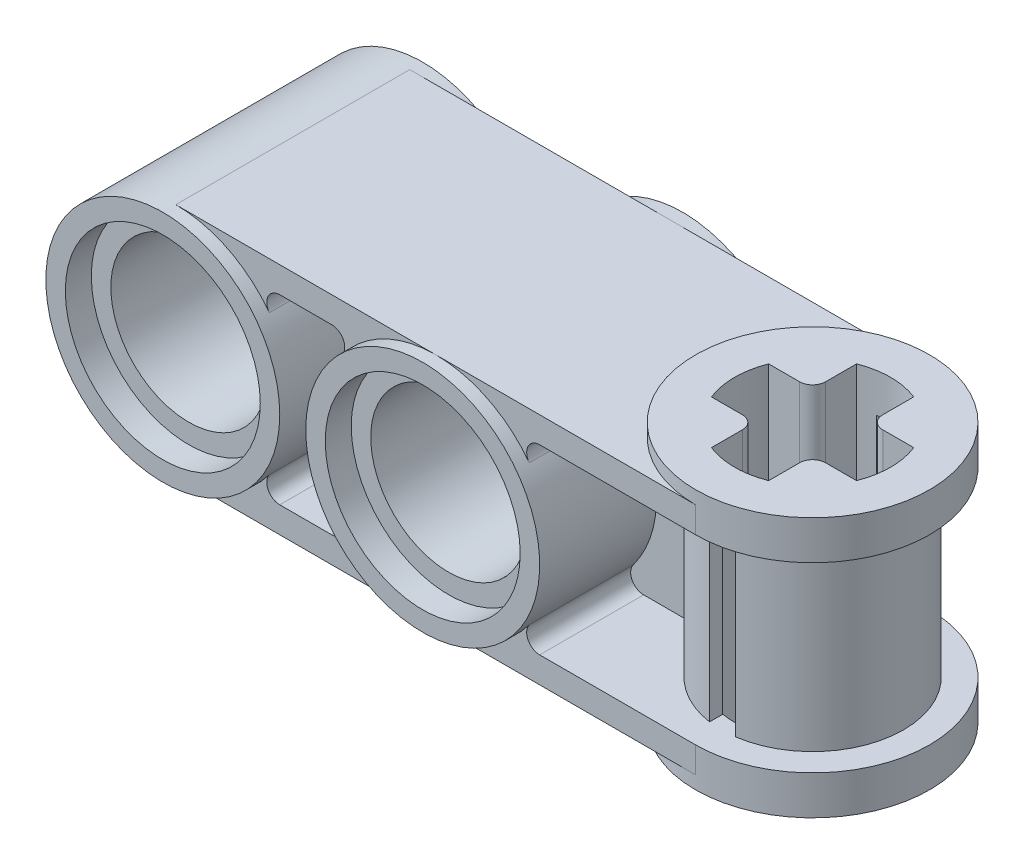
ISO-10303-21;
HEADER;
FILE_DESCRIPTION(('STEP AP214'),'2;1');
FILE_NAME('part.step','',(''),(''),'','','');
FILE_SCHEMA(('AUTOMOTIVE_DESIGN { 1 0 10303 214 1 1 1 1 }'));
ENDSEC;
DATA;
#1=APPLICATION_CONTEXT('core data for automotive mechanical design processes');
#2=APPLICATION_PROTOCOL_DEFINITION('international standard','automotive_design',2000,#1);
#3=PRODUCT_CONTEXT('',#1,'mechanical');
#4=PRODUCT('Part','Part','',(#3));
#5=PRODUCT_RELATED_PRODUCT_CATEGORY('part','',(#4));
#6=PRODUCT_DEFINITION_FORMATION('','',#4);
#7=PRODUCT_DEFINITION_CONTEXT('part definition',#1,'design');
#8=PRODUCT_DEFINITION('design','',#6,#7);
#9=PRODUCT_DEFINITION_SHAPE('','',#8);
#10=(LENGTH_UNIT() NAMED_UNIT(*) SI_UNIT(.MILLI.,.METRE.));
#11=(NAMED_UNIT(*) PLANE_ANGLE_UNIT() SI_UNIT($,.RADIAN.));
#12=(NAMED_UNIT(*) SI_UNIT($,.STERADIAN.) SOLID_ANGLE_UNIT());
#13=UNCERTAINTY_MEASURE_WITH_UNIT(LENGTH_MEASURE(1.E-05),#10,'distance_accuracy_value','');
#14=(GEOMETRIC_REPRESENTATION_CONTEXT(3) GLOBAL_UNCERTAINTY_ASSIGNED_CONTEXT((#13)) GLOBAL_UNIT_ASSIGNED_CONTEXT((#10,
#11,#12)) REPRESENTATION_CONTEXT('',''));
#15=CARTESIAN_POINT('',(0.,0.,0.));
#16=DIRECTION('',(0.,0.,1.));
#17=DIRECTION('',(1.,0.,0.));
#18=AXIS2_PLACEMENT_3D('',#15,#16,#17);
#19=CARTESIAN_POINT('',(-8.,0.,-4.));
#20=DIRECTION('',(0.,0.,-1.));
#21=DIRECTION('',(-1.,0.,0.));
#22=AXIS2_PLACEMENT_3D('',#19,#20,#21);
#23=PLANE('',#22);
#24=CARTESIAN_POINT('',(-16.,0.,-4.));
#25=DIRECTION('',(0.,0.,1.));
#26=DIRECTION('',(1.,0.,0.));
#27=AXIS2_PLACEMENT_3D('',#24,#25,#26);
#28=CIRCLE('',#27,3.);
#29=CARTESIAN_POINT('',(-13.,0.,-4.));
#30=VERTEX_POINT('',#29);
#31=EDGE_CURVE('E771',#30,#30,#28,.T.);
#32=ORIENTED_EDGE('',*,*,#31,.T.);
#33=EDGE_LOOP('',(#32));
#34=FACE_BOUND('',#33,.T.);
#35=CARTESIAN_POINT('',(-16.,0.,-4.));
#36=DIRECTION('',(0.,0.,1.));
#37=DIRECTION('',(1.,0.,0.));
#38=AXIS2_PLACEMENT_3D('',#35,#36,#37);
#39=CIRCLE('',#38,3.6);
#40=CARTESIAN_POINT('',(-12.4,0.,-4.));
#41=VERTEX_POINT('',#40);
#42=EDGE_CURVE('E436',#41,#41,#39,.T.);
#43=ORIENTED_EDGE('',*,*,#42,.F.);
#44=EDGE_LOOP('',(#43));
#45=FACE_BOUND('',#44,.T.);
#46=ADVANCED_FACE('F38',(#34,#45),#23,.T.);
#47=CARTESIAN_POINT('',(-8.,0.,-4.));
#48=DIRECTION('',(0.,0.,1.));
#49=DIRECTION('',(1.,0.,0.));
#50=AXIS2_PLACEMENT_3D('',#47,#48,#49);
#51=CIRCLE('',#50,3.);
#52=CARTESIAN_POINT('',(-5.,0.,-4.));
#53=VERTEX_POINT('',#52);
#54=EDGE_CURVE('E698',#53,#53,#51,.T.);
#55=ORIENTED_EDGE('',*,*,#54,.T.);
#56=EDGE_LOOP('',(#55));
#57=FACE_BOUND('',#56,.T.);
#58=CARTESIAN_POINT('',(-8.,0.,-4.));
#59=DIRECTION('',(0.,0.,1.));
#60=DIRECTION('',(-1.,0.,0.));
#61=AXIS2_PLACEMENT_3D('',#58,#59,#60);
#62=CIRCLE('',#61,3.6);
#63=CARTESIAN_POINT('',(-11.6,0.,-4.));
#64=VERTEX_POINT('',#63);
#65=EDGE_CURVE('E709',#64,#64,#62,.T.);
#66=ORIENTED_EDGE('',*,*,#65,.F.);
#67=EDGE_LOOP('',(#66));
#68=FACE_BOUND('',#67,.T.);
#69=ADVANCED_FACE('F860',(#57,#68),#23,.T.);
#70=CARTESIAN_POINT('',(0.,3.6,0.));
#71=DIRECTION('',(0.,1.,0.));
#72=DIRECTION('',(0.,0.,1.));
#73=AXIS2_PLACEMENT_3D('',#70,#71,#72);
#74=PLANE('',#73);
#75=DIRECTION('',(-1.,0.,0.));
#76=VECTOR('',#75,1.);
#77=CARTESIAN_POINT('',(0.,3.6,-3.6));
#78=LINE('',#77,#76);
#79=CARTESIAN_POINT('',(0.,3.6,-3.6));
#80=VERTEX_POINT('',#79);
#81=CARTESIAN_POINT('',(-8.,3.6,-3.6));
#82=VERTEX_POINT('',#81);
#83=EDGE_CURVE('E421',#80,#82,#78,.T.);
#84=ORIENTED_EDGE('',*,*,#83,.T.);
#85=DIRECTION('',(-1.,0.,0.));
#86=VECTOR('',#85,1.);
#87=CARTESIAN_POINT('',(0.,3.6,-3.6));
#88=LINE('',#87,#86);
#89=CARTESIAN_POINT('',(-16.,3.6,-3.6));
#90=VERTEX_POINT('',#89);
#91=EDGE_CURVE('E403',#82,#90,#88,.T.);
#92=ORIENTED_EDGE('',*,*,#91,.T.);
#93=DIRECTION('',(0.,0.,1.));
#94=VECTOR('',#93,1.);
#95=CARTESIAN_POINT('',(-16.,3.6,-4.));
#96=LINE('',#95,#94);
#97=CARTESIAN_POINT('',(-16.,3.6,3.6));
#98=VERTEX_POINT('',#97);
#99=EDGE_CURVE('E417',#90,#98,#96,.T.);
#100=ORIENTED_EDGE('',*,*,#99,.T.);
#101=DIRECTION('',(1.,0.,0.));
#102=VECTOR('',#101,1.);
#103=CARTESIAN_POINT('',(0.,3.6,3.6));
#104=LINE('',#103,#102);
#105=CARTESIAN_POINT('',(-8.,3.6,3.6));
#106=VERTEX_POINT('',#105);
#107=EDGE_CURVE('E799',#98,#106,#104,.T.);
#108=ORIENTED_EDGE('',*,*,#107,.T.);
#109=DIRECTION('',(1.,0.,0.));
#110=VECTOR('',#109,1.);
#111=CARTESIAN_POINT('',(0.,3.6,3.6));
#112=LINE('',#111,#110);
#113=CARTESIAN_POINT('',(0.,3.6,3.6));
#114=VERTEX_POINT('',#113);
#115=EDGE_CURVE('E724',#106,#114,#112,.T.);
#116=ORIENTED_EDGE('',*,*,#115,.T.);
#117=CARTESIAN_POINT('',(0.,3.6,0.));
#118=DIRECTION('',(0.,1.,0.));
#119=DIRECTION('',(0.,0.,1.));
#120=AXIS2_PLACEMENT_3D('',#117,#118,#119);
#121=CIRCLE('',#120,3.6);
#122=EDGE_CURVE('E737',#114,#80,#121,.F.);
#123=ORIENTED_EDGE('',*,*,#122,.T.);
#124=EDGE_LOOP('',(#84,#92,#100,#108,#116,#123));
#125=FACE_BOUND('',#124,.T.);
#126=ADVANCED_FACE('F415',(#125),#74,.T.);
#127=CARTESIAN_POINT('',(0.,-3.6,0.));
#128=DIRECTION('',(0.,1.,0.));
#129=DIRECTION('',(0.,0.,1.));
#130=AXIS2_PLACEMENT_3D('',#127,#128,#129);
#131=PLANE('',#130);
#132=DIRECTION('',(-1.,0.,0.));
#133=VECTOR('',#132,1.);
#134=CARTESIAN_POINT('',(0.,-3.6,-3.6));
#135=LINE('',#134,#133);
#136=CARTESIAN_POINT('',(-8.,-3.6,-3.6));
#137=VERTEX_POINT('',#136);
#138=CARTESIAN_POINT('',(-16.,-3.6,-3.6));
#139=VERTEX_POINT('',#138);
#140=EDGE_CURVE('E423',#137,#139,#135,.T.);
#141=ORIENTED_EDGE('',*,*,#140,.F.);
#142=DIRECTION('',(-1.,0.,0.));
#143=VECTOR('',#142,1.);
#144=CARTESIAN_POINT('',(0.,-3.6,-3.6));
#145=LINE('',#144,#143);
#146=CARTESIAN_POINT('',(0.,-3.6,-3.6));
#147=VERTEX_POINT('',#146);
#148=EDGE_CURVE('E727',#147,#137,#145,.T.);
#149=ORIENTED_EDGE('',*,*,#148,.F.);
#150=CARTESIAN_POINT('',(0.,-3.6,0.));
#151=DIRECTION('',(0.,1.,0.));
#152=DIRECTION('',(0.,0.,1.));
#153=AXIS2_PLACEMENT_3D('',#150,#151,#152);
#154=CIRCLE('',#153,3.6);
#155=CARTESIAN_POINT('',(0.,-3.6,3.6));
#156=VERTEX_POINT('',#155);
#157=EDGE_CURVE('E747',#147,#156,#154,.T.);
#158=ORIENTED_EDGE('',*,*,#157,.T.);
#159=DIRECTION('',(1.,0.,0.));
#160=VECTOR('',#159,1.);
#161=CARTESIAN_POINT('',(0.,-3.6,3.6));
#162=LINE('',#161,#160);
#163=CARTESIAN_POINT('',(-8.,-3.6,3.6));
#164=VERTEX_POINT('',#163);
#165=EDGE_CURVE('E730',#164,#156,#162,.T.);
#166=ORIENTED_EDGE('',*,*,#165,.F.);
#167=DIRECTION('',(1.,0.,0.));
#168=VECTOR('',#167,1.);
#169=CARTESIAN_POINT('',(0.,-3.6,3.6));
#170=LINE('',#169,#168);
#171=CARTESIAN_POINT('',(-16.,-3.6,3.6));
#172=VERTEX_POINT('',#171);
#173=EDGE_CURVE('E797',#172,#164,#170,.T.);
#174=ORIENTED_EDGE('',*,*,#173,.F.);
#175=DIRECTION('',(0.,0.,1.));
#176=VECTOR('',#175,1.);
#177=CARTESIAN_POINT('',(-16.,-3.6,-4.));
#178=LINE('',#177,#176);
#179=EDGE_CURVE('E432',#139,#172,#178,.T.);
#180=ORIENTED_EDGE('',*,*,#179,.F.);
#181=EDGE_LOOP('',(#141,#149,#158,#166,#174,#180));
#182=FACE_BOUND('',#181,.T.);
#183=ADVANCED_FACE('F885',(#182),#131,.F.);
#184=CARTESIAN_POINT('',(-11.2,-2.4,-0.8));
#185=DIRECTION('',(0.,0.,-1.));
#186=DIRECTION('',(-1.,0.,0.));
#187=AXIS2_PLACEMENT_3D('',#184,#185,#186);
#188=CYLINDRICAL_SURFACE('',#187,0.4);
#189=DIRECTION('',(0.,0.,-1.));
#190=VECTOR('',#189,1.);
#191=CARTESIAN_POINT('',(-10.88,-2.16,-0.8));
#192=LINE('',#191,#190);
#193=CARTESIAN_POINT('',(-10.88,-2.16,-0.8));
#194=VERTEX_POINT('',#193);
#195=CARTESIAN_POINT('',(-10.88,-2.16,-3.6));
#196=VERTEX_POINT('',#195);
#197=EDGE_CURVE('E776',#194,#196,#192,.T.);
#198=ORIENTED_EDGE('',*,*,#197,.T.);
#199=CARTESIAN_POINT('',(-11.2,-2.4,-3.6));
#200=DIRECTION('',(0.,0.,-1.));
#201=DIRECTION('',(-1.,0.,0.));
#202=AXIS2_PLACEMENT_3D('',#199,#200,#201);
#203=CIRCLE('',#202,0.4);
#204=CARTESIAN_POINT('',(-11.2,-2.8,-3.6));
#205=VERTEX_POINT('',#204);
#206=EDGE_CURVE('E1146',#196,#205,#203,.T.);
#207=ORIENTED_EDGE('',*,*,#206,.T.);
#208=DIRECTION('',(0.,0.,-1.));
#209=VECTOR('',#208,1.);
#210=CARTESIAN_POINT('',(-11.2,-2.8,-0.8));
#211=LINE('',#210,#209);
#212=CARTESIAN_POINT('',(-11.2,-2.8,-0.8));
#213=VERTEX_POINT('',#212);
#214=EDGE_CURVE('E779',#213,#205,#211,.T.);
#215=ORIENTED_EDGE('',*,*,#214,.F.);
#216=CARTESIAN_POINT('',(-11.2,-2.4,-0.8));
#217=DIRECTION('',(0.,0.,1.));
#218=DIRECTION('',(1.,0.,0.));
#219=AXIS2_PLACEMENT_3D('',#216,#217,#218);
#220=CIRCLE('',#219,0.4);
#221=EDGE_CURVE('E422',#213,#194,#220,.T.);
#222=ORIENTED_EDGE('',*,*,#221,.T.);
#223=EDGE_LOOP('',(#198,#207,#215,#222));
#224=FACE_BOUND('',#223,.T.);
#225=ADVANCED_FACE('F888',(#224),#188,.F.);
#226=CARTESIAN_POINT('',(-11.2,2.4,-0.8));
#227=DIRECTION('',(0.,0.,-1.));
#228=DIRECTION('',(-1.,0.,0.));
#229=AXIS2_PLACEMENT_3D('',#226,#227,#228);
#230=CYLINDRICAL_SURFACE('',#229,0.4);
#231=DIRECTION('',(0.,0.,-1.));
#232=VECTOR('',#231,1.);
#233=CARTESIAN_POINT('',(-11.2,2.8,-0.8));
#234=LINE('',#233,#232);
#235=CARTESIAN_POINT('',(-11.2,2.8,-0.8));
#236=VERTEX_POINT('',#235);
#237=CARTESIAN_POINT('',(-11.2,2.8,-3.6));
#238=VERTEX_POINT('',#237);
#239=EDGE_CURVE('E1172',#236,#238,#234,.T.);
#240=ORIENTED_EDGE('',*,*,#239,.T.);
#241=CARTESIAN_POINT('',(-11.2,2.4,-3.6));
#242=DIRECTION('',(0.,0.,-1.));
#243=DIRECTION('',(-1.,0.,0.));
#244=AXIS2_PLACEMENT_3D('',#241,#242,#243);
#245=CIRCLE('',#244,0.4);
#246=CARTESIAN_POINT('',(-10.88,2.16,-3.6));
#247=VERTEX_POINT('',#246);
#248=EDGE_CURVE('E1151',#238,#247,#245,.T.);
#249=ORIENTED_EDGE('',*,*,#248,.T.);
#250=DIRECTION('',(0.,0.,-1.));
#251=VECTOR('',#250,1.);
#252=CARTESIAN_POINT('',(-10.88,2.16,-0.8));
#253=LINE('',#252,#251);
#254=CARTESIAN_POINT('',(-10.88,2.16,-0.8));
#255=VERTEX_POINT('',#254);
#256=EDGE_CURVE('E1141',#255,#247,#253,.T.);
#257=ORIENTED_EDGE('',*,*,#256,.F.);
#258=CARTESIAN_POINT('',(-11.2,2.4,-0.8));
#259=DIRECTION('',(0.,0.,1.));
#260=DIRECTION('',(1.,0.,0.));
#261=AXIS2_PLACEMENT_3D('',#258,#259,#260);
#262=CIRCLE('',#261,0.4);
#263=EDGE_CURVE('E1166',#255,#236,#262,.T.);
#264=ORIENTED_EDGE('',*,*,#263,.T.);
#265=EDGE_LOOP('',(#240,#249,#257,#264));
#266=FACE_BOUND('',#265,.T.);
#267=ADVANCED_FACE('F1199',(#266),#230,.F.);
#268=CARTESIAN_POINT('',(-12.8,2.8,-0.8));
#269=DIRECTION('',(0.,-1.,0.));
#270=DIRECTION('',(0.,0.,-1.));
#271=AXIS2_PLACEMENT_3D('',#268,#269,#270);
#272=PLANE('',#271);
#273=DIRECTION('',(0.,0.,-1.));
#274=VECTOR('',#273,1.);
#275=CARTESIAN_POINT('',(-12.8,2.8,-0.8));
#276=LINE('',#275,#274);
#277=CARTESIAN_POINT('',(-12.8,2.8,-0.8));
#278=VERTEX_POINT('',#277);
#279=CARTESIAN_POINT('',(-12.8,2.8,-3.6));
#280=VERTEX_POINT('',#279);
#281=EDGE_CURVE('E1175',#278,#280,#276,.T.);
#282=ORIENTED_EDGE('',*,*,#281,.T.);
#283=DIRECTION('',(1.,0.,0.));
#284=VECTOR('',#283,1.);
#285=CARTESIAN_POINT('',(-12.8,2.8,-3.6));
#286=LINE('',#285,#284);
#287=EDGE_CURVE('E53',#280,#238,#286,.T.);
#288=ORIENTED_EDGE('',*,*,#287,.T.);
#289=ORIENTED_EDGE('',*,*,#239,.F.);
#290=DIRECTION('',(-1.,0.,0.));
#291=VECTOR('',#290,1.);
#292=CARTESIAN_POINT('',(-12.8,2.8,-0.8));
#293=LINE('',#292,#291);
#294=EDGE_CURVE('E1164',#236,#278,#293,.T.);
#295=ORIENTED_EDGE('',*,*,#294,.T.);
#296=EDGE_LOOP('',(#282,#288,#289,#295));
#297=FACE_BOUND('',#296,.T.);
#298=ADVANCED_FACE('F1202',(#297),#272,.T.);
#299=CARTESIAN_POINT('',(-12.8,2.4,-0.8));
#300=DIRECTION('',(0.,0.,-1.));
#301=DIRECTION('',(-1.,0.,0.));
#302=AXIS2_PLACEMENT_3D('',#299,#300,#301);
#303=CYLINDRICAL_SURFACE('',#302,0.4);
#304=DIRECTION('',(0.,0.,-1.));
#305=VECTOR('',#304,1.);
#306=CARTESIAN_POINT('',(-13.12,2.16,-0.8));
#307=LINE('',#306,#305);
#308=CARTESIAN_POINT('',(-13.12,2.16,-0.8));
#309=VERTEX_POINT('',#308);
#310=CARTESIAN_POINT('',(-13.12,2.16,-3.6));
#311=VERTEX_POINT('',#310);
#312=EDGE_CURVE('E1178',#309,#311,#307,.T.);
#313=ORIENTED_EDGE('',*,*,#312,.T.);
#314=CARTESIAN_POINT('',(-12.8,2.4,-3.6));
#315=DIRECTION('',(0.,0.,-1.));
#316=DIRECTION('',(-1.,0.,0.));
#317=AXIS2_PLACEMENT_3D('',#314,#315,#316);
#318=CIRCLE('',#317,0.4);
#319=EDGE_CURVE('E405',#311,#280,#318,.T.);
#320=ORIENTED_EDGE('',*,*,#319,.T.);
#321=ORIENTED_EDGE('',*,*,#281,.F.);
#322=CARTESIAN_POINT('',(-12.8,2.4,-0.8));
#323=DIRECTION('',(0.,0.,1.));
#324=DIRECTION('',(-1.,0.,0.));
#325=AXIS2_PLACEMENT_3D('',#322,#323,#324);
#326=CIRCLE('',#325,0.4);
#327=EDGE_CURVE('E1162',#278,#309,#326,.T.);
#328=ORIENTED_EDGE('',*,*,#327,.T.);
#329=EDGE_LOOP('',(#313,#320,#321,#328));
#330=FACE_BOUND('',#329,.T.);
#331=ADVANCED_FACE('F1206',(#330),#303,.F.);
#332=CARTESIAN_POINT('',(-12.8,-2.4,-0.8));
#333=DIRECTION('',(0.,0.,-1.));
#334=DIRECTION('',(-1.,0.,0.));
#335=AXIS2_PLACEMENT_3D('',#332,#333,#334);
#336=CYLINDRICAL_SURFACE('',#335,0.4);
#337=DIRECTION('',(0.,0.,-1.));
#338=VECTOR('',#337,1.);
#339=CARTESIAN_POINT('',(-12.8,-2.8,-0.8));
#340=LINE('',#339,#338);
#341=CARTESIAN_POINT('',(-12.8,-2.8,-0.8));
#342=VERTEX_POINT('',#341);
#343=CARTESIAN_POINT('',(-12.8,-2.8,-3.6));
#344=VERTEX_POINT('',#343);
#345=EDGE_CURVE('E1182',#342,#344,#340,.T.);
#346=ORIENTED_EDGE('',*,*,#345,.T.);
#347=CARTESIAN_POINT('',(-12.8,-2.4,-3.6));
#348=DIRECTION('',(0.,0.,-1.));
#349=DIRECTION('',(-1.,0.,0.));
#350=AXIS2_PLACEMENT_3D('',#347,#348,#349);
#351=CIRCLE('',#350,0.4);
#352=CARTESIAN_POINT('',(-13.12,-2.16,-3.6));
#353=VERTEX_POINT('',#352);
#354=EDGE_CURVE('E61',#344,#353,#351,.T.);
#355=ORIENTED_EDGE('',*,*,#354,.T.);
#356=DIRECTION('',(0.,0.,-1.));
#357=VECTOR('',#356,1.);
#358=CARTESIAN_POINT('',(-13.12,-2.16,-0.8));
#359=LINE('',#358,#357);
#360=CARTESIAN_POINT('',(-13.12,-2.16,-0.8));
#361=VERTEX_POINT('',#360);
#362=EDGE_CURVE('E1180',#361,#353,#359,.T.);
#363=ORIENTED_EDGE('',*,*,#362,.F.);
#364=CARTESIAN_POINT('',(-12.8,-2.4,-0.8));
#365=DIRECTION('',(0.,0.,1.));
#366=DIRECTION('',(1.,0.,0.));
#367=AXIS2_PLACEMENT_3D('',#364,#365,#366);
#368=CIRCLE('',#367,0.4);
#369=EDGE_CURVE('E1158',#361,#342,#368,.T.);
#370=ORIENTED_EDGE('',*,*,#369,.T.);
#371=EDGE_LOOP('',(#346,#355,#363,#370));
#372=FACE_BOUND('',#371,.T.);
#373=ADVANCED_FACE('F1209',(#372),#336,.F.);
#374=CARTESIAN_POINT('',(-12.8,-2.8,-0.8));
#375=DIRECTION('',(0.,1.,0.));
#376=DIRECTION('',(0.,0.,1.));
#377=AXIS2_PLACEMENT_3D('',#374,#375,#376);
#378=PLANE('',#377);
#379=ORIENTED_EDGE('',*,*,#214,.T.);
#380=DIRECTION('',(-1.,0.,0.));
#381=VECTOR('',#380,1.);
#382=CARTESIAN_POINT('',(-12.8,-2.8,-3.6));
#383=LINE('',#382,#381);
#384=EDGE_CURVE('E11',#205,#344,#383,.T.);
#385=ORIENTED_EDGE('',*,*,#384,.T.);
#386=ORIENTED_EDGE('',*,*,#345,.F.);
#387=DIRECTION('',(1.,0.,0.));
#388=VECTOR('',#387,1.);
#389=CARTESIAN_POINT('',(-12.8,-2.8,-0.8));
#390=LINE('',#389,#388);
#391=EDGE_CURVE('E1156',#342,#213,#390,.T.);
#392=ORIENTED_EDGE('',*,*,#391,.T.);
#393=EDGE_LOOP('',(#379,#385,#386,#392));
#394=FACE_BOUND('',#393,.T.);
#395=ADVANCED_FACE('F1189',(#394),#378,.T.);
#396=CARTESIAN_POINT('',(-16.,0.,-4.));
#397=DIRECTION('',(0.,0.,1.));
#398=DIRECTION('',(1.,0.,0.));
#399=AXIS2_PLACEMENT_3D('',#396,#397,#398);
#400=CYLINDRICAL_SURFACE('',#399,2.4);
#401=CARTESIAN_POINT('',(-16.,0.,3.2));
#402=DIRECTION('',(0.,0.,1.));
#403=DIRECTION('',(1.,0.,0.));
#404=AXIS2_PLACEMENT_3D('',#401,#402,#403);
#405=CIRCLE('',#404,2.4);
#406=CARTESIAN_POINT('',(-13.6,0.,3.2));
#407=VERTEX_POINT('',#406);
#408=EDGE_CURVE('E758',#407,#407,#405,.F.);
#409=ORIENTED_EDGE('',*,*,#408,.F.);
#410=EDGE_LOOP('',(#409));
#411=FACE_BOUND('',#410,.T.);
#412=CARTESIAN_POINT('',(-16.,0.,-3.2));
#413=DIRECTION('',(0.,0.,-1.));
#414=DIRECTION('',(-1.,0.,0.));
#415=AXIS2_PLACEMENT_3D('',#412,#413,#414);
#416=CIRCLE('',#415,2.4);
#417=CARTESIAN_POINT('',(-18.4,0.,-3.2));
#418=VERTEX_POINT('',#417);
#419=EDGE_CURVE('E762',#418,#418,#416,.F.);
#420=ORIENTED_EDGE('',*,*,#419,.F.);
#421=EDGE_LOOP('',(#420));
#422=FACE_BOUND('',#421,.T.);
#423=ADVANCED_FACE('F875',(#411,#422),#400,.F.);
#424=CARTESIAN_POINT('',(-8.,0.,4.));
#425=DIRECTION('',(0.,0.,-1.));
#426=DIRECTION('',(-1.,0.,0.));
#427=AXIS2_PLACEMENT_3D('',#424,#425,#426);
#428=PLANE('',#427);
#429=CARTESIAN_POINT('',(-16.,0.,4.));
#430=DIRECTION('',(0.,0.,1.));
#431=DIRECTION('',(1.,0.,0.));
#432=AXIS2_PLACEMENT_3D('',#429,#430,#431);
#433=CIRCLE('',#432,3.);
#434=CARTESIAN_POINT('',(-13.,0.,4.));
#435=VERTEX_POINT('',#434);
#436=EDGE_CURVE('E829',#435,#435,#433,.T.);
#437=ORIENTED_EDGE('',*,*,#436,.F.);
#438=EDGE_LOOP('',(#437));
#439=FACE_BOUND('',#438,.T.);
#440=CARTESIAN_POINT('',(-16.,0.,4.));
#441=DIRECTION('',(0.,0.,1.));
#442=DIRECTION('',(1.,0.,0.));
#443=AXIS2_PLACEMENT_3D('',#440,#441,#442);
#444=CIRCLE('',#443,3.6);
#445=CARTESIAN_POINT('',(-12.4,0.,4.));
#446=VERTEX_POINT('',#445);
#447=EDGE_CURVE('E760',#446,#446,#444,.T.);
#448=ORIENTED_EDGE('',*,*,#447,.T.);
#449=EDGE_LOOP('',(#448));
#450=FACE_BOUND('',#449,.T.);
#451=ADVANCED_FACE('F871',(#439,#450),#428,.F.);
#452=CARTESIAN_POINT('',(-8.,0.,4.));
#453=DIRECTION('',(0.,0.,1.));
#454=DIRECTION('',(1.,0.,0.));
#455=AXIS2_PLACEMENT_3D('',#452,#453,#454);
#456=CIRCLE('',#455,3.);
#457=CARTESIAN_POINT('',(-5.,0.,4.));
#458=VERTEX_POINT('',#457);
#459=EDGE_CURVE('E705',#458,#458,#456,.T.);
#460=ORIENTED_EDGE('',*,*,#459,.F.);
#461=EDGE_LOOP('',(#460));
#462=FACE_BOUND('',#461,.T.);
#463=CARTESIAN_POINT('',(-8.,0.,4.));
#464=DIRECTION('',(0.,0.,1.));
#465=DIRECTION('',(-1.,0.,0.));
#466=AXIS2_PLACEMENT_3D('',#463,#464,#465);
#467=CIRCLE('',#466,3.6);
#468=CARTESIAN_POINT('',(-11.6,0.,4.));
#469=VERTEX_POINT('',#468);
#470=EDGE_CURVE('E712',#469,#469,#467,.T.);
#471=ORIENTED_EDGE('',*,*,#470,.T.);
#472=EDGE_LOOP('',(#471));
#473=FACE_BOUND('',#472,.T.);
#474=ADVANCED_FACE('F874',(#462,#473),#428,.F.);
#475=CARTESIAN_POINT('',(-11.2,-2.4,0.8));
#476=DIRECTION('',(0.,0.,1.));
#477=DIRECTION('',(1.,0.,0.));
#478=AXIS2_PLACEMENT_3D('',#475,#476,#477);
#479=CYLINDRICAL_SURFACE('',#478,0.4);
#480=CARTESIAN_POINT('',(-11.2,-2.4,3.6));
#481=DIRECTION('',(0.,0.,1.));
#482=DIRECTION('',(1.,0.,0.));
#483=AXIS2_PLACEMENT_3D('',#480,#481,#482);
#484=CIRCLE('',#483,0.4);
#485=CARTESIAN_POINT('',(-10.88,-2.16,3.6));
#486=VERTEX_POINT('',#485);
#487=CARTESIAN_POINT('',(-11.2,-2.8,3.6));
#488=VERTEX_POINT('',#487);
#489=EDGE_CURVE('E795',#486,#488,#484,.F.);
#490=ORIENTED_EDGE('',*,*,#489,.F.);
#491=DIRECTION('',(0.,0.,1.));
#492=VECTOR('',#491,1.);
#493=CARTESIAN_POINT('',(-10.88,-2.16,0.8));
#494=LINE('',#493,#492);
#495=CARTESIAN_POINT('',(-10.88,-2.16,0.8));
#496=VERTEX_POINT('',#495);
#497=EDGE_CURVE('E825',#496,#486,#494,.T.);
#498=ORIENTED_EDGE('',*,*,#497,.F.);
#499=CARTESIAN_POINT('',(-11.2,-2.4,0.8));
#500=DIRECTION('',(0.,0.,1.));
#501=DIRECTION('',(1.,0.,0.));
#502=AXIS2_PLACEMENT_3D('',#499,#500,#501);
#503=CIRCLE('',#502,0.4);
#504=CARTESIAN_POINT('',(-11.2,-2.8,0.8));
#505=VERTEX_POINT('',#504);
#506=EDGE_CURVE('E801',#505,#496,#503,.T.);
#507=ORIENTED_EDGE('',*,*,#506,.F.);
#508=DIRECTION('',(0.,0.,1.));
#509=VECTOR('',#508,1.);
#510=CARTESIAN_POINT('',(-11.2,-2.8,0.8));
#511=LINE('',#510,#509);
#512=EDGE_CURVE('E826',#505,#488,#511,.T.);
#513=ORIENTED_EDGE('',*,*,#512,.T.);
#514=EDGE_LOOP('',(#490,#498,#507,#513));
#515=FACE_BOUND('',#514,.T.);
#516=ADVANCED_FACE('F1122',(#515),#479,.F.);
#517=CARTESIAN_POINT('',(-12.8,-2.8,0.8));
#518=DIRECTION('',(0.,-1.,0.));
#519=DIRECTION('',(0.,0.,-1.));
#520=AXIS2_PLACEMENT_3D('',#517,#518,#519);
#521=PLANE('',#520);
#522=DIRECTION('',(-1.,0.,0.));
#523=VECTOR('',#522,1.);
#524=CARTESIAN_POINT('',(-12.8,-2.8,3.6));
#525=LINE('',#524,#523);
#526=CARTESIAN_POINT('',(-12.8,-2.8,3.6));
#527=VERTEX_POINT('',#526);
#528=EDGE_CURVE('E793',#488,#527,#525,.T.);
#529=ORIENTED_EDGE('',*,*,#528,.F.);
#530=ORIENTED_EDGE('',*,*,#512,.F.);
#531=DIRECTION('',(1.,0.,0.));
#532=VECTOR('',#531,1.);
#533=CARTESIAN_POINT('',(-12.8,-2.8,0.8));
#534=LINE('',#533,#532);
#535=CARTESIAN_POINT('',(-12.8,-2.8,0.8));
#536=VERTEX_POINT('',#535);
#537=EDGE_CURVE('E822',#536,#505,#534,.T.);
#538=ORIENTED_EDGE('',*,*,#537,.F.);
#539=DIRECTION('',(0.,0.,1.));
#540=VECTOR('',#539,1.);
#541=CARTESIAN_POINT('',(-12.8,-2.8,0.8));
#542=LINE('',#541,#540);
#543=EDGE_CURVE('E830',#536,#527,#542,.T.);
#544=ORIENTED_EDGE('',*,*,#543,.T.);
#545=EDGE_LOOP('',(#529,#530,#538,#544));
#546=FACE_BOUND('',#545,.T.);
#547=ADVANCED_FACE('F1239',(#546),#521,.F.);
#548=CARTESIAN_POINT('',(-12.8,-2.4,0.8));
#549=DIRECTION('',(0.,0.,1.));
#550=DIRECTION('',(1.,0.,0.));
#551=AXIS2_PLACEMENT_3D('',#548,#549,#550);
#552=CYLINDRICAL_SURFACE('',#551,0.4);
#553=CARTESIAN_POINT('',(-12.8,-2.4,3.6));
#554=DIRECTION('',(0.,0.,1.));
#555=DIRECTION('',(1.,0.,0.));
#556=AXIS2_PLACEMENT_3D('',#553,#554,#555);
#557=CIRCLE('',#556,0.4);
#558=CARTESIAN_POINT('',(-13.12,-2.16,3.6));
#559=VERTEX_POINT('',#558);
#560=EDGE_CURVE('E791',#527,#559,#557,.F.);
#561=ORIENTED_EDGE('',*,*,#560,.F.);
#562=ORIENTED_EDGE('',*,*,#543,.F.);
#563=CARTESIAN_POINT('',(-12.8,-2.4,0.8));
#564=DIRECTION('',(0.,0.,1.));
#565=DIRECTION('',(1.,0.,0.));
#566=AXIS2_PLACEMENT_3D('',#563,#564,#565);
#567=CIRCLE('',#566,0.4);
#568=CARTESIAN_POINT('',(-13.12,-2.16,0.8));
#569=VERTEX_POINT('',#568);
#570=EDGE_CURVE('E819',#569,#536,#567,.T.);
#571=ORIENTED_EDGE('',*,*,#570,.F.);
#572=DIRECTION('',(0.,0.,1.));
#573=VECTOR('',#572,1.);
#574=CARTESIAN_POINT('',(-13.12,-2.16,0.8));
#575=LINE('',#574,#573);
#576=EDGE_CURVE('E833',#569,#559,#575,.T.);
#577=ORIENTED_EDGE('',*,*,#576,.T.);
#578=EDGE_LOOP('',(#561,#562,#571,#577));
#579=FACE_BOUND('',#578,.T.);
#580=ADVANCED_FACE('F1242',(#579),#552,.F.);
#581=CARTESIAN_POINT('',(-12.8,2.4,0.8));
#582=DIRECTION('',(0.,0.,1.));
#583=DIRECTION('',(1.,0.,0.));
#584=AXIS2_PLACEMENT_3D('',#581,#582,#583);
#585=CYLINDRICAL_SURFACE('',#584,0.4);
#586=CARTESIAN_POINT('',(-12.8,2.4,3.6));
#587=DIRECTION('',(0.,0.,1.));
#588=DIRECTION('',(1.,0.,0.));
#589=AXIS2_PLACEMENT_3D('',#586,#587,#588);
#590=CIRCLE('',#589,0.4);
#591=CARTESIAN_POINT('',(-13.12,2.16,3.6));
#592=VERTEX_POINT('',#591);
#593=CARTESIAN_POINT('',(-12.8,2.8,3.6));
#594=VERTEX_POINT('',#593);
#595=EDGE_CURVE('E789',#592,#594,#590,.F.);
#596=ORIENTED_EDGE('',*,*,#595,.F.);
#597=DIRECTION('',(0.,0.,1.));
#598=VECTOR('',#597,1.);
#599=CARTESIAN_POINT('',(-13.12,2.16,0.8));
#600=LINE('',#599,#598);
#601=CARTESIAN_POINT('',(-13.12,2.16,0.8));
#602=VERTEX_POINT('',#601);
#603=EDGE_CURVE('E836',#602,#592,#600,.T.);
#604=ORIENTED_EDGE('',*,*,#603,.F.);
#605=CARTESIAN_POINT('',(-12.8,2.4,0.8));
#606=DIRECTION('',(0.,0.,1.));
#607=DIRECTION('',(-1.,0.,0.));
#608=AXIS2_PLACEMENT_3D('',#605,#606,#607);
#609=CIRCLE('',#608,0.4);
#610=CARTESIAN_POINT('',(-12.8,2.8,0.8));
#611=VERTEX_POINT('',#610);
#612=EDGE_CURVE('E813',#611,#602,#609,.T.);
#613=ORIENTED_EDGE('',*,*,#612,.F.);
#614=DIRECTION('',(0.,0.,1.));
#615=VECTOR('',#614,1.);
#616=CARTESIAN_POINT('',(-12.8,2.8,0.8));
#617=LINE('',#616,#615);
#618=EDGE_CURVE('E838',#611,#594,#617,.T.);
#619=ORIENTED_EDGE('',*,*,#618,.T.);
#620=EDGE_LOOP('',(#596,#604,#613,#619));
#621=FACE_BOUND('',#620,.T.);
#622=ADVANCED_FACE('F1246',(#621),#585,.F.);
#623=CARTESIAN_POINT('',(-12.8,2.8,0.8));
#624=DIRECTION('',(0.,1.,0.));
#625=DIRECTION('',(0.,0.,1.));
#626=AXIS2_PLACEMENT_3D('',#623,#624,#625);
#627=PLANE('',#626);
#628=DIRECTION('',(1.,0.,0.));
#629=VECTOR('',#628,1.);
#630=CARTESIAN_POINT('',(-12.8,2.8,3.6));
#631=LINE('',#630,#629);
#632=CARTESIAN_POINT('',(-11.2,2.8,3.6));
#633=VERTEX_POINT('',#632);
#634=EDGE_CURVE('E787',#594,#633,#631,.T.);
#635=ORIENTED_EDGE('',*,*,#634,.F.);
#636=ORIENTED_EDGE('',*,*,#618,.F.);
#637=DIRECTION('',(-1.,0.,0.));
#638=VECTOR('',#637,1.);
#639=CARTESIAN_POINT('',(-12.8,2.8,0.8));
#640=LINE('',#639,#638);
#641=CARTESIAN_POINT('',(-11.2,2.8,0.8));
#642=VERTEX_POINT('',#641);
#643=EDGE_CURVE('E810',#642,#611,#640,.T.);
#644=ORIENTED_EDGE('',*,*,#643,.F.);
#645=DIRECTION('',(0.,0.,1.));
#646=VECTOR('',#645,1.);
#647=CARTESIAN_POINT('',(-11.2,2.8,0.8));
#648=LINE('',#647,#646);
#649=EDGE_CURVE('E841',#642,#633,#648,.T.);
#650=ORIENTED_EDGE('',*,*,#649,.T.);
#651=EDGE_LOOP('',(#635,#636,#644,#650));
#652=FACE_BOUND('',#651,.T.);
#653=ADVANCED_FACE('F1250',(#652),#627,.F.);
#654=CARTESIAN_POINT('',(-11.2,2.4,0.8));
#655=DIRECTION('',(0.,0.,1.));
#656=DIRECTION('',(1.,0.,0.));
#657=AXIS2_PLACEMENT_3D('',#654,#655,#656);
#658=CYLINDRICAL_SURFACE('',#657,0.4);
#659=CARTESIAN_POINT('',(-11.2,2.4,3.6));
#660=DIRECTION('',(0.,0.,1.));
#661=DIRECTION('',(1.,0.,0.));
#662=AXIS2_PLACEMENT_3D('',#659,#660,#661);
#663=CIRCLE('',#662,0.4);
#664=CARTESIAN_POINT('',(-10.88,2.16,3.6));
#665=VERTEX_POINT('',#664);
#666=EDGE_CURVE('E785',#633,#665,#663,.F.);
#667=ORIENTED_EDGE('',*,*,#666,.F.);
#668=ORIENTED_EDGE('',*,*,#649,.F.);
#669=CARTESIAN_POINT('',(-11.2,2.4,0.8));
#670=DIRECTION('',(0.,0.,1.));
#671=DIRECTION('',(1.,0.,0.));
#672=AXIS2_PLACEMENT_3D('',#669,#670,#671);
#673=CIRCLE('',#672,0.4);
#674=CARTESIAN_POINT('',(-10.88,2.16,0.8));
#675=VERTEX_POINT('',#674);
#676=EDGE_CURVE('E807',#675,#642,#673,.T.);
#677=ORIENTED_EDGE('',*,*,#676,.F.);
#678=DIRECTION('',(0.,0.,1.));
#679=VECTOR('',#678,1.);
#680=CARTESIAN_POINT('',(-10.88,2.16,0.8));
#681=LINE('',#680,#679);
#682=EDGE_CURVE('E844',#675,#665,#681,.T.);
#683=ORIENTED_EDGE('',*,*,#682,.T.);
#684=EDGE_LOOP('',(#667,#668,#677,#683));
#685=FACE_BOUND('',#684,.T.);
#686=ADVANCED_FACE('F881',(#685),#658,.F.);
#687=CARTESIAN_POINT('',(-8.,0.,4.));
#688=DIRECTION('',(0.,0.,-1.));
#689=DIRECTION('',(-1.,0.,0.));
#690=AXIS2_PLACEMENT_3D('',#687,#688,#689);
#691=CYLINDRICAL_SURFACE('',#690,3.6);
#692=ORIENTED_EDGE('',*,*,#470,.F.);
#693=EDGE_LOOP('',(#692));
#694=FACE_BOUND('',#693,.T.);
#695=CARTESIAN_POINT('',(-8.,0.,3.6));
#696=DIRECTION('',(0.,0.,1.));
#697=DIRECTION('',(1.,0.,0.));
#698=AXIS2_PLACEMENT_3D('',#695,#696,#697);
#699=CIRCLE('',#698,3.6);
#700=CARTESIAN_POINT('',(-5.12,2.16,3.6));
#701=VERTEX_POINT('',#700);
#702=EDGE_CURVE('E720',#106,#701,#699,.F.);
#703=ORIENTED_EDGE('',*,*,#702,.F.);
#704=CARTESIAN_POINT('',(-8.,0.,3.6));
#705=DIRECTION('',(0.,0.,-1.));
#706=DIRECTION('',(1.,0.,0.));
#707=AXIS2_PLACEMENT_3D('',#704,#705,#706);
#708=CIRCLE('',#707,3.6);
#709=EDGE_CURVE('E782',#665,#106,#708,.T.);
#710=ORIENTED_EDGE('',*,*,#709,.F.);
#711=ORIENTED_EDGE('',*,*,#682,.F.);
#712=CARTESIAN_POINT('',(-8.,0.,0.8));
#713=DIRECTION('',(0.,0.,-1.));
#714=DIRECTION('',(1.,0.,0.));
#715=AXIS2_PLACEMENT_3D('',#712,#713,#714);
#716=CIRCLE('',#715,3.6);
#717=EDGE_CURVE('E804',#496,#675,#716,.T.);
#718=ORIENTED_EDGE('',*,*,#717,.F.);
#719=ORIENTED_EDGE('',*,*,#497,.T.);
#720=EDGE_CURVE('E783',#164,#486,#708,.T.);
#721=ORIENTED_EDGE('',*,*,#720,.F.);
#722=CARTESIAN_POINT('',(-5.12,-2.16,3.6));
#723=VERTEX_POINT('',#722);
#724=EDGE_CURVE('E719',#723,#164,#699,.F.);
#725=ORIENTED_EDGE('',*,*,#724,.F.);
#726=DIRECTION('',(0.,0.,1.));
#727=VECTOR('',#726,1.);
#728=CARTESIAN_POINT('',(-5.12,-2.16,0.4));
#729=LINE('',#728,#727);
#730=CARTESIAN_POINT('',(-5.12,-2.16,0.4));
#731=VERTEX_POINT('',#730);
#732=EDGE_CURVE('E552',#731,#723,#729,.T.);
#733=ORIENTED_EDGE('',*,*,#732,.F.);
#734=CARTESIAN_POINT('',(-8.,0.,0.4));
#735=DIRECTION('',(0.,0.,-1.));
#736=DIRECTION('',(1.,0.,0.));
#737=AXIS2_PLACEMENT_3D('',#734,#735,#736);
#738=CIRCLE('',#737,3.6);
#739=CARTESIAN_POINT('',(-5.12,2.16,0.4));
#740=VERTEX_POINT('',#739);
#741=EDGE_CURVE('E540',#740,#731,#738,.T.);
#742=ORIENTED_EDGE('',*,*,#741,.F.);
#743=DIRECTION('',(0.,0.,1.));
#744=VECTOR('',#743,1.);
#745=CARTESIAN_POINT('',(-5.12,2.16,0.4));
#746=LINE('',#745,#744);
#747=EDGE_CURVE('E555',#740,#701,#746,.T.);
#748=ORIENTED_EDGE('',*,*,#747,.T.);
#749=EDGE_LOOP('',(#703,#710,#711,#718,#719,#721,#725,#733,#742,#748));
#750=FACE_BOUND('',#749,.T.);
#751=ADVANCED_FACE('F877',(#694,#750),#691,.T.);
#752=CARTESIAN_POINT('',(-8.,0.,-3.6));
#753=DIRECTION('',(0.,0.,-1.));
#754=DIRECTION('',(-1.,0.,0.));
#755=AXIS2_PLACEMENT_3D('',#752,#753,#754);
#756=CIRCLE('',#755,3.6);
#757=CARTESIAN_POINT('',(-5.12,-2.16,-3.6));
#758=VERTEX_POINT('',#757);
#759=EDGE_CURVE('E716',#137,#758,#756,.F.);
#760=ORIENTED_EDGE('',*,*,#759,.F.);
#761=CARTESIAN_POINT('',(-8.,0.,-3.6));
#762=DIRECTION('',(0.,0.,-1.));
#763=DIRECTION('',(1.,0.,0.));
#764=AXIS2_PLACEMENT_3D('',#761,#762,#763);
#765=CIRCLE('',#764,3.6);
#766=EDGE_CURVE('E937',#137,#196,#765,.T.);
#767=ORIENTED_EDGE('',*,*,#766,.T.);
#768=ORIENTED_EDGE('',*,*,#197,.F.);
#769=CARTESIAN_POINT('',(-8.,0.,-0.8));
#770=DIRECTION('',(0.,0.,-1.));
#771=DIRECTION('',(1.,0.,0.));
#772=AXIS2_PLACEMENT_3D('',#769,#770,#771);
#773=CIRCLE('',#772,3.6);
#774=EDGE_CURVE('E1168',#194,#255,#773,.T.);
#775=ORIENTED_EDGE('',*,*,#774,.T.);
#776=ORIENTED_EDGE('',*,*,#256,.T.);
#777=EDGE_CURVE('E410',#247,#82,#765,.T.);
#778=ORIENTED_EDGE('',*,*,#777,.T.);
#779=CARTESIAN_POINT('',(-5.12,2.16,-3.6));
#780=VERTEX_POINT('',#779);
#781=EDGE_CURVE('E715',#780,#82,#756,.F.);
#782=ORIENTED_EDGE('',*,*,#781,.F.);
#783=DIRECTION('',(0.,0.,-1.));
#784=VECTOR('',#783,1.);
#785=CARTESIAN_POINT('',(-5.12,2.16,-0.4));
#786=LINE('',#785,#784);
#787=CARTESIAN_POINT('',(-5.12,2.16,-0.4));
#788=VERTEX_POINT('',#787);
#789=EDGE_CURVE('E524',#788,#780,#786,.T.);
#790=ORIENTED_EDGE('',*,*,#789,.F.);
#791=CARTESIAN_POINT('',(-8.,0.,-0.4));
#792=DIRECTION('',(0.,0.,-1.));
#793=DIRECTION('',(1.,0.,0.));
#794=AXIS2_PLACEMENT_3D('',#791,#792,#793);
#795=CIRCLE('',#794,3.6);
#796=CARTESIAN_POINT('',(-5.12,-2.16,-0.4));
#797=VERTEX_POINT('',#796);
#798=EDGE_CURVE('E499',#788,#797,#795,.T.);
#799=ORIENTED_EDGE('',*,*,#798,.T.);
#800=DIRECTION('',(0.,0.,-1.));
#801=VECTOR('',#800,1.);
#802=CARTESIAN_POINT('',(-5.12,-2.16,-0.4));
#803=LINE('',#802,#801);
#804=EDGE_CURVE('E508',#797,#758,#803,.T.);
#805=ORIENTED_EDGE('',*,*,#804,.T.);
#806=EDGE_LOOP('',(#760,#767,#768,#775,#776,#778,#782,#790,#799,#805));
#807=FACE_BOUND('',#806,.T.);
#808=ORIENTED_EDGE('',*,*,#65,.T.);
#809=EDGE_LOOP('',(#808));
#810=FACE_BOUND('',#809,.T.);
#811=ADVANCED_FACE('F880',(#807,#810),#691,.T.);
#812=CARTESIAN_POINT('',(0.,2.8,0.));
#813=DIRECTION('',(0.,-1.,0.));
#814=DIRECTION('',(0.,0.,-1.));
#815=AXIS2_PLACEMENT_3D('',#812,#813,#814);
#816=CYLINDRICAL_SURFACE('',#815,2.8);
#817=DIRECTION('',(0.,-1.,0.));
#818=VECTOR('',#817,1.);
#819=CARTESIAN_POINT('',(0.4,2.8,2.7712812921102));
#820=LINE('',#819,#818);
#821=CARTESIAN_POINT('',(0.4,-2.8,2.7712812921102));
#822=VERTEX_POINT('',#821);
#823=CARTESIAN_POINT('',(0.4,2.8,2.7712812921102));
#824=VERTEX_POINT('',#823);
#825=EDGE_CURVE('E46',#822,#824,#820,.F.);
#826=ORIENTED_EDGE('',*,*,#825,.F.);
#827=CARTESIAN_POINT('',(0.,-2.8,0.));
#828=DIRECTION('',(0.,-1.,0.));
#829=DIRECTION('',(0.,0.,1.));
#830=AXIS2_PLACEMENT_3D('',#827,#828,#829);
#831=CIRCLE('',#830,2.8);
#832=CARTESIAN_POINT('',(0.4,-2.8,-2.7712812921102));
#833=VERTEX_POINT('',#832);
#834=EDGE_CURVE('E480',#833,#822,#831,.T.);
#835=ORIENTED_EDGE('',*,*,#834,.F.);
#836=DIRECTION('',(0.,-1.,0.));
#837=VECTOR('',#836,1.);
#838=CARTESIAN_POINT('',(0.4,2.8,-2.7712812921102));
#839=LINE('',#838,#837);
#840=CARTESIAN_POINT('',(0.399999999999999,2.8,-2.7712812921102));
#841=VERTEX_POINT('',#840);
#842=EDGE_CURVE('E754',#841,#833,#839,.T.);
#843=ORIENTED_EDGE('',*,*,#842,.F.);
#844=CARTESIAN_POINT('',(0.,2.8,0.));
#845=DIRECTION('',(0.,-1.,0.));
#846=DIRECTION('',(0.,0.,1.));
#847=AXIS2_PLACEMENT_3D('',#844,#845,#846);
#848=CIRCLE('',#847,2.8);
#849=EDGE_CURVE('E485',#841,#824,#848,.T.);
#850=ORIENTED_EDGE('',*,*,#849,.T.);
#851=EDGE_LOOP('',(#826,#835,#843,#850));
#852=FACE_BOUND('',#851,.T.);
#853=ADVANCED_FACE('F915',(#852),#816,.T.);
#854=DIRECTION('',(0.,-1.,0.));
#855=VECTOR('',#854,1.);
#856=CARTESIAN_POINT('',(-0.4,2.8,-2.7712812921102));
#857=LINE('',#856,#855);
#858=CARTESIAN_POINT('',(-0.4,-2.8,-2.7712812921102));
#859=VERTEX_POINT('',#858);
#860=CARTESIAN_POINT('',(-0.4,2.8,-2.7712812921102));
#861=VERTEX_POINT('',#860);
#862=EDGE_CURVE('E751',#859,#861,#857,.F.);
#863=ORIENTED_EDGE('',*,*,#862,.F.);
#864=CARTESIAN_POINT('',(-2.7712812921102,-2.8,-0.4));
#865=VERTEX_POINT('',#864);
#866=EDGE_CURVE('E476',#865,#859,#831,.T.);
#867=ORIENTED_EDGE('',*,*,#866,.F.);
#868=DIRECTION('',(0.,-1.,0.));
#869=VECTOR('',#868,1.);
#870=CARTESIAN_POINT('',(-2.7712812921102,2.8,-0.4));
#871=LINE('',#870,#869);
#872=CARTESIAN_POINT('',(-2.7712812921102,2.8,-0.4));
#873=VERTEX_POINT('',#872);
#874=EDGE_CURVE('E484',#873,#865,#871,.T.);
#875=ORIENTED_EDGE('',*,*,#874,.F.);
#876=EDGE_CURVE('E481',#873,#861,#848,.T.);
#877=ORIENTED_EDGE('',*,*,#876,.T.);
#878=EDGE_LOOP('',(#863,#867,#875,#877));
#879=FACE_BOUND('',#878,.T.);
#880=ADVANCED_FACE('F908',(#879),#816,.T.);
#881=CARTESIAN_POINT('',(0.,-3.6,-3.6));
#882=DIRECTION('',(0.,0.,-1.));
#883=DIRECTION('',(-1.,0.,0.));
#884=AXIS2_PLACEMENT_3D('',#881,#882,#883);
#885=PLANE('',#884);
#886=DIRECTION('',(1.,0.,0.));
#887=VECTOR('',#886,1.);
#888=CARTESIAN_POINT('',(-4.8,-2.8,-3.6));
#889=LINE('',#888,#887);
#890=CARTESIAN_POINT('',(-4.8,-2.8,-3.6));
#891=VERTEX_POINT('',#890);
#892=CARTESIAN_POINT('',(0.,-2.8,-3.6));
#893=VERTEX_POINT('',#892);
#894=EDGE_CURVE('E500',#891,#893,#889,.T.);
#895=ORIENTED_EDGE('',*,*,#894,.T.);
#896=DIRECTION('',(0.,1.,0.));
#897=VECTOR('',#896,1.);
#898=CARTESIAN_POINT('',(0.,-3.6,-3.6));
#899=LINE('',#898,#897);
#900=EDGE_CURVE('E739',#147,#893,#899,.T.);
#901=ORIENTED_EDGE('',*,*,#900,.F.);
#902=ORIENTED_EDGE('',*,*,#148,.T.);
#903=ORIENTED_EDGE('',*,*,#759,.T.);
#904=CARTESIAN_POINT('',(-4.8,-2.4,-3.6));
#905=DIRECTION('',(0.,0.,1.));
#906=DIRECTION('',(1.,0.,0.));
#907=AXIS2_PLACEMENT_3D('',#904,#905,#906);
#908=CIRCLE('',#907,0.4);
#909=EDGE_CURVE('E495',#758,#891,#908,.T.);
#910=ORIENTED_EDGE('',*,*,#909,.T.);
#911=EDGE_LOOP('',(#895,#901,#902,#903,#910));
#912=FACE_BOUND('',#911,.T.);
#913=ADVANCED_FACE('F898',(#912),#885,.T.);
#914=CARTESIAN_POINT('',(0.,-3.6,0.));
#915=DIRECTION('',(0.,1.,0.));
#916=DIRECTION('',(0.,0.,1.));
#917=AXIS2_PLACEMENT_3D('',#914,#915,#916);
#918=CYLINDRICAL_SURFACE('',#917,3.6);
#919=CARTESIAN_POINT('',(0.,-4.,0.));
#920=DIRECTION('',(0.,1.,0.));
#921=DIRECTION('',(0.,0.,1.));
#922=AXIS2_PLACEMENT_3D('',#919,#920,#921);
#923=CIRCLE('',#922,3.6);
#924=CARTESIAN_POINT('',(0.,-4.,3.6));
#925=VERTEX_POINT('',#924);
#926=EDGE_CURVE('E659',#925,#925,#923,.T.);
#927=ORIENTED_EDGE('',*,*,#926,.T.);
#928=EDGE_LOOP('',(#927));
#929=FACE_BOUND('',#928,.T.);
#930=ORIENTED_EDGE('',*,*,#900,.T.);
#931=CARTESIAN_POINT('',(0.,-2.8,0.));
#932=DIRECTION('',(0.,1.,0.));
#933=DIRECTION('',(0.,0.,1.));
#934=AXIS2_PLACEMENT_3D('',#931,#932,#933);
#935=CIRCLE('',#934,3.6);
#936=CARTESIAN_POINT('',(0.,-2.8,3.6));
#937=VERTEX_POINT('',#936);
#938=EDGE_CURVE('E491',#893,#937,#935,.F.);
#939=ORIENTED_EDGE('',*,*,#938,.T.);
#940=DIRECTION('',(0.,1.,0.));
#941=VECTOR('',#940,1.);
#942=CARTESIAN_POINT('',(0.,-3.6,3.6));
#943=LINE('',#942,#941);
#944=EDGE_CURVE('E734',#156,#937,#943,.T.);
#945=ORIENTED_EDGE('',*,*,#944,.F.);
#946=ORIENTED_EDGE('',*,*,#157,.F.);
#947=EDGE_LOOP('',(#930,#939,#945,#946));
#948=FACE_BOUND('',#947,.T.);
#949=ADVANCED_FACE('F904',(#929,#948),#918,.T.);
#950=CARTESIAN_POINT('',(0.,-3.6,3.6));
#951=DIRECTION('',(0.,0.,1.));
#952=DIRECTION('',(1.,0.,0.));
#953=AXIS2_PLACEMENT_3D('',#950,#951,#952);
#954=PLANE('',#953);
#955=ORIENTED_EDGE('',*,*,#944,.T.);
#956=DIRECTION('',(1.,0.,0.));
#957=VECTOR('',#956,1.);
#958=CARTESIAN_POINT('',(-4.8,-2.8,3.6));
#959=LINE('',#958,#957);
#960=CARTESIAN_POINT('',(-4.8,-2.8,3.6));
#961=VERTEX_POINT('',#960);
#962=EDGE_CURVE('E546',#961,#937,#959,.T.);
#963=ORIENTED_EDGE('',*,*,#962,.F.);
#964=CARTESIAN_POINT('',(-4.8,-2.4,3.6));
#965=DIRECTION('',(0.,0.,1.));
#966=DIRECTION('',(1.,0.,0.));
#967=AXIS2_PLACEMENT_3D('',#964,#965,#966);
#968=CIRCLE('',#967,0.4);
#969=EDGE_CURVE('E520',#723,#961,#968,.T.);
#970=ORIENTED_EDGE('',*,*,#969,.F.);
#971=ORIENTED_EDGE('',*,*,#724,.T.);
#972=ORIENTED_EDGE('',*,*,#165,.T.);
#973=EDGE_LOOP('',(#955,#963,#970,#971,#972));
#974=FACE_BOUND('',#973,.T.);
#975=ADVANCED_FACE('F894',(#974),#954,.T.);
#976=CARTESIAN_POINT('',(0.,2.8,-3.6));
#977=VERTEX_POINT('',#976);
#978=EDGE_CURVE('E733',#977,#80,#899,.T.);
#979=ORIENTED_EDGE('',*,*,#978,.F.);
#980=DIRECTION('',(-1.,0.,0.));
#981=VECTOR('',#980,1.);
#982=CARTESIAN_POINT('',(-4.8,2.8,-3.6));
#983=LINE('',#982,#981);
#984=CARTESIAN_POINT('',(-4.8,2.8,-3.6));
#985=VERTEX_POINT('',#984);
#986=EDGE_CURVE('E514',#977,#985,#983,.T.);
#987=ORIENTED_EDGE('',*,*,#986,.T.);
#988=CARTESIAN_POINT('',(-4.8,2.4,-3.6));
#989=DIRECTION('',(0.,0.,1.));
#990=DIRECTION('',(1.,0.,0.));
#991=AXIS2_PLACEMENT_3D('',#988,#989,#990);
#992=CIRCLE('',#991,0.4);
#993=EDGE_CURVE('E511',#985,#780,#992,.T.);
#994=ORIENTED_EDGE('',*,*,#993,.T.);
#995=ORIENTED_EDGE('',*,*,#781,.T.);
#996=ORIENTED_EDGE('',*,*,#83,.F.);
#997=EDGE_LOOP('',(#979,#987,#994,#995,#996));
#998=FACE_BOUND('',#997,.T.);
#999=ADVANCED_FACE('F895',(#998),#885,.T.);
#1000=CARTESIAN_POINT('',(-8.,0.,-4.));
#1001=DIRECTION('',(0.,0.,1.));
#1002=DIRECTION('',(1.,0.,0.));
#1003=AXIS2_PLACEMENT_3D('',#1000,#1001,#1002);
#1004=CYLINDRICAL_SURFACE('',#1003,2.4);
#1005=CARTESIAN_POINT('',(-8.,0.,3.2));
#1006=DIRECTION('',(0.,0.,1.));
#1007=DIRECTION('',(1.,0.,0.));
#1008=AXIS2_PLACEMENT_3D('',#1005,#1006,#1007);
#1009=CIRCLE('',#1008,2.4);
#1010=CARTESIAN_POINT('',(-5.6,0.,3.2));
#1011=VERTEX_POINT('',#1010);
#1012=EDGE_CURVE('E708',#1011,#1011,#1009,.F.);
#1013=CARTESIAN_POINT('',(-8.,0.,-3.2));
#1014=DIRECTION('',(0.,0.,-1.));
#1015=DIRECTION('',(-1.,0.,0.));
#1016=AXIS2_PLACEMENT_3D('',#1013,#1014,#1015);
#1017=CIRCLE('',#1016,2.4);
#1018=CARTESIAN_POINT('',(-5.6,0.,-3.2));
#1019=VERTEX_POINT('',#1018);
#1020=EDGE_CURVE('E701',#1019,#1019,#1017,.F.);
#1021=CARTESIAN_POINT('',(-5.6,0.,3.2));
#1022=CARTESIAN_POINT('',(-5.6,0.,3.13333333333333));
#1023=CARTESIAN_POINT('',(-5.6,0.,3.06666666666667));
#1024=CARTESIAN_POINT('',(-5.6,0.,2.93333333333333));
#1025=CARTESIAN_POINT('',(-5.6,0.,2.86666666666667));
#1026=CARTESIAN_POINT('',(-5.6,0.,2.73333333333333));
#1027=CARTESIAN_POINT('',(-5.6,0.,2.66666666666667));
#1028=CARTESIAN_POINT('',(-5.6,0.,2.53333333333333));
#1029=CARTESIAN_POINT('',(-5.6,0.,2.46666666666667));
#1030=CARTESIAN_POINT('',(-5.6,0.,2.33333333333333));
#1031=CARTESIAN_POINT('',(-5.6,0.,2.26666666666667));
#1032=CARTESIAN_POINT('',(-5.6,0.,2.13333333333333));
#1033=CARTESIAN_POINT('',(-5.6,0.,2.06666666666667));
#1034=CARTESIAN_POINT('',(-5.6,0.,1.93333333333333));
#1035=CARTESIAN_POINT('',(-5.6,0.,1.86666666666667));
#1036=CARTESIAN_POINT('',(-5.6,0.,1.73333333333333));
#1037=CARTESIAN_POINT('',(-5.6,0.,1.66666666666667));
#1038=CARTESIAN_POINT('',(-5.6,0.,1.53333333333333));
#1039=CARTESIAN_POINT('',(-5.6,0.,1.46666666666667));
#1040=CARTESIAN_POINT('',(-5.6,0.,1.33333333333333));
#1041=CARTESIAN_POINT('',(-5.6,0.,1.26666666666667));
#1042=CARTESIAN_POINT('',(-5.6,0.,1.13333333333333));
#1043=CARTESIAN_POINT('',(-5.6,0.,1.06666666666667));
#1044=CARTESIAN_POINT('',(-5.6,0.,0.933333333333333));
#1045=CARTESIAN_POINT('',(-5.6,0.,0.866666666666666));
#1046=CARTESIAN_POINT('',(-5.6,0.,0.733333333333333));
#1047=CARTESIAN_POINT('',(-5.6,0.,0.666666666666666));
#1048=CARTESIAN_POINT('',(-5.6,0.,0.533333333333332));
#1049=CARTESIAN_POINT('',(-5.6,0.,0.466666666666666));
#1050=CARTESIAN_POINT('',(-5.6,0.,0.333333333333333));
#1051=CARTESIAN_POINT('',(-5.6,0.,0.266666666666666));
#1052=CARTESIAN_POINT('',(-5.6,0.,0.133333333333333));
#1053=CARTESIAN_POINT('',(-5.6,0.,0.066666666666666));
#1054=CARTESIAN_POINT('',(-5.6,0.,-0.0666666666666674));
#1055=CARTESIAN_POINT('',(-5.6,0.,-0.133333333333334));
#1056=CARTESIAN_POINT('',(-5.6,0.,-0.266666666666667));
#1057=CARTESIAN_POINT('',(-5.6,0.,-0.333333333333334));
#1058=CARTESIAN_POINT('',(-5.6,0.,-0.466666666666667));
#1059=CARTESIAN_POINT('',(-5.6,0.,-0.533333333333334));
#1060=CARTESIAN_POINT('',(-5.6,0.,-0.666666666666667));
#1061=CARTESIAN_POINT('',(-5.6,0.,-0.733333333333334));
#1062=CARTESIAN_POINT('',(-5.6,0.,-0.866666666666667));
#1063=CARTESIAN_POINT('',(-5.6,0.,-0.933333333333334));
#1064=CARTESIAN_POINT('',(-5.6,0.,-1.06666666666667));
#1065=CARTESIAN_POINT('',(-5.6,0.,-1.13333333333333));
#1066=CARTESIAN_POINT('',(-5.6,0.,-1.26666666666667));
#1067=CARTESIAN_POINT('',(-5.6,0.,-1.33333333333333));
#1068=CARTESIAN_POINT('',(-5.6,0.,-1.46666666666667));
#1069=CARTESIAN_POINT('',(-5.6,0.,-1.53333333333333));
#1070=CARTESIAN_POINT('',(-5.6,0.,-1.66666666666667));
#1071=CARTESIAN_POINT('',(-5.6,0.,-1.73333333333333));
#1072=CARTESIAN_POINT('',(-5.6,0.,-1.86666666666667));
#1073=CARTESIAN_POINT('',(-5.6,0.,-1.93333333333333));
#1074=CARTESIAN_POINT('',(-5.6,0.,-2.06666666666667));
#1075=CARTESIAN_POINT('',(-5.6,0.,-2.13333333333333));
#1076=CARTESIAN_POINT('',(-5.6,0.,-2.26666666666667));
#1077=CARTESIAN_POINT('',(-5.6,0.,-2.33333333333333));
#1078=CARTESIAN_POINT('',(-5.6,0.,-2.46666666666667));
#1079=CARTESIAN_POINT('',(-5.6,0.,-2.53333333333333));
#1080=CARTESIAN_POINT('',(-5.6,0.,-2.66666666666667));
#1081=CARTESIAN_POINT('',(-5.6,0.,-2.73333333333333));
#1082=CARTESIAN_POINT('',(-5.6,0.,-2.86666666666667));
#1083=CARTESIAN_POINT('',(-5.6,0.,-2.93333333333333));
#1084=CARTESIAN_POINT('',(-5.6,0.,-3.06666666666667));
#1085=CARTESIAN_POINT('',(-5.6,0.,-3.13333333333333));
#1086=CARTESIAN_POINT('',(-5.6,0.,-3.2));
#1087=B_SPLINE_CURVE_WITH_KNOTS('',3,(#1021,#1022,#1023,#1024,#1025,#1026,#1027,#1028,#1029,
#1030,#1031,#1032,#1033,#1034,#1035,#1036,#1037,#1038,#1039,#1040,#1041,#1042,#1043,#1044,#1045,
#1046,#1047,#1048,#1049,#1050,#1051,#1052,#1053,#1054,#1055,#1056,#1057,#1058,#1059,#1060,#1061,
#1062,#1063,#1064,#1065,#1066,#1067,#1068,#1069,#1070,#1071,#1072,#1073,#1074,#1075,#1076,#1077,
#1078,#1079,#1080,#1081,#1082,#1083,#1084,#1085,#1086),.UNSPECIFIED.,.F.,.F.,(4,2,2,2,2,2,2,2,2,
2,2,2,2,2,2,2,2,2,2,2,2,2,2,2,2,2,2,2,2,2,2,2,4),(0.,0.2,0.4,0.6,0.8,1.,1.2,1.4,1.6,1.8,2.,2.2,
2.4,2.6,2.8,3.,3.2,3.4,3.6,3.8,4.,4.2,4.4,4.6,4.8,5.,5.2,5.4,5.6,5.8,6.,6.2,6.4),.UNSPECIFIED.);
#1088=EDGE_CURVE('BSEAM869',#1011,#1019,#1087,.T.);
#1089=ORIENTED_EDGE('',*,*,#1012,.F.);
#1090=ORIENTED_EDGE('',*,*,#1020,.F.);
#1091=ORIENTED_EDGE('',*,*,#1088,.T.);
#1092=ORIENTED_EDGE('',*,*,#1088,.F.);
#1093=EDGE_LOOP('',(#1089,#1091,#1090,#1092));
#1094=FACE_BOUND('',#1093,.T.);
#1095=ADVANCED_FACE('F869',(#1094),#1004,.F.);
#1096=CARTESIAN_POINT('',(0.,2.8,0.));
#1097=DIRECTION('',(0.,1.,0.));
#1098=DIRECTION('',(0.,0.,1.));
#1099=AXIS2_PLACEMENT_3D('',#1096,#1097,#1098);
#1100=CIRCLE('',#1099,3.6);
#1101=CARTESIAN_POINT('',(0.,2.8,3.6));
#1102=VERTEX_POINT('',#1101);
#1103=EDGE_CURVE('E493',#977,#1102,#1100,.F.);
#1104=ORIENTED_EDGE('',*,*,#1103,.F.);
#1105=ORIENTED_EDGE('',*,*,#978,.T.);
#1106=ORIENTED_EDGE('',*,*,#122,.F.);
#1107=EDGE_CURVE('E738',#1102,#114,#943,.T.);
#1108=ORIENTED_EDGE('',*,*,#1107,.F.);
#1109=EDGE_LOOP('',(#1104,#1105,#1106,#1108));
#1110=FACE_BOUND('',#1109,.T.);
#1111=CARTESIAN_POINT('',(0.,4.,0.));
#1112=DIRECTION('',(0.,1.,0.));
#1113=DIRECTION('',(0.,0.,1.));
#1114=AXIS2_PLACEMENT_3D('',#1111,#1112,#1113);
#1115=CIRCLE('',#1114,3.6);
#1116=CARTESIAN_POINT('',(0.,4.,3.6));
#1117=VERTEX_POINT('',#1116);
#1118=EDGE_CURVE('E692',#1117,#1117,#1115,.T.);
#1119=ORIENTED_EDGE('',*,*,#1118,.F.);
#1120=EDGE_LOOP('',(#1119));
#1121=FACE_BOUND('',#1120,.T.);
#1122=ADVANCED_FACE('F40',(#1110,#1121),#918,.T.);
#1123=DIRECTION('',(-1.,0.,0.));
#1124=VECTOR('',#1123,1.);
#1125=CARTESIAN_POINT('',(-4.8,2.8,3.6));
#1126=LINE('',#1125,#1124);
#1127=CARTESIAN_POINT('',(-4.8,2.8,3.6));
#1128=VERTEX_POINT('',#1127);
#1129=EDGE_CURVE('E549',#1102,#1128,#1126,.T.);
#1130=ORIENTED_EDGE('',*,*,#1129,.F.);
#1131=ORIENTED_EDGE('',*,*,#1107,.T.);
#1132=ORIENTED_EDGE('',*,*,#115,.F.);
#1133=ORIENTED_EDGE('',*,*,#702,.T.);
#1134=CARTESIAN_POINT('',(-4.8,2.4,3.6));
#1135=DIRECTION('',(0.,0.,1.));
#1136=DIRECTION('',(1.,0.,0.));
#1137=AXIS2_PLACEMENT_3D('',#1134,#1135,#1136);
#1138=CIRCLE('',#1137,0.4);
#1139=EDGE_CURVE('E532',#1128,#701,#1138,.T.);
#1140=ORIENTED_EDGE('',*,*,#1139,.F.);
#1141=EDGE_LOOP('',(#1130,#1131,#1132,#1133,#1140));
#1142=FACE_BOUND('',#1141,.T.);
#1143=ADVANCED_FACE('F890',(#1142),#954,.T.);
#1144=CARTESIAN_POINT('',(-8.,0.,3.2));
#1145=DIRECTION('',(0.,0.,1.));
#1146=DIRECTION('',(1.,0.,0.));
#1147=AXIS2_PLACEMENT_3D('',#1144,#1145,#1146);
#1148=PLANE('',#1147);
#1149=CARTESIAN_POINT('',(-8.,0.,3.2));
#1150=DIRECTION('',(0.,0.,1.));
#1151=DIRECTION('',(1.,0.,0.));
#1152=AXIS2_PLACEMENT_3D('',#1149,#1150,#1151);
#1153=CIRCLE('',#1152,3.);
#1154=CARTESIAN_POINT('',(-5.,0.,3.2));
#1155=VERTEX_POINT('',#1154);
#1156=EDGE_CURVE('E702',#1155,#1155,#1153,.T.);
#1157=ORIENTED_EDGE('',*,*,#1156,.T.);
#1158=EDGE_LOOP('',(#1157));
#1159=FACE_BOUND('',#1158,.T.);
#1160=ORIENTED_EDGE('',*,*,#1012,.T.);
#1161=EDGE_LOOP('',(#1160));
#1162=FACE_BOUND('',#1161,.T.);
#1163=ADVANCED_FACE('F892',(#1159,#1162),#1148,.T.);
#1164=CARTESIAN_POINT('',(-8.,0.,4.));
#1165=DIRECTION('',(0.,0.,-1.));
#1166=DIRECTION('',(-1.,0.,0.));
#1167=AXIS2_PLACEMENT_3D('',#1164,#1165,#1166);
#1168=CYLINDRICAL_SURFACE('',#1167,3.);
#1169=ORIENTED_EDGE('',*,*,#459,.T.);
#1170=EDGE_LOOP('',(#1169));
#1171=FACE_BOUND('',#1170,.T.);
#1172=ORIENTED_EDGE('',*,*,#1156,.F.);
#1173=EDGE_LOOP('',(#1172));
#1174=FACE_BOUND('',#1173,.T.);
#1175=ADVANCED_FACE('F1100',(#1171,#1174),#1168,.F.);
#1176=CARTESIAN_POINT('',(-8.,0.,-3.2));
#1177=DIRECTION('',(0.,0.,-1.));
#1178=DIRECTION('',(1.,0.,0.));
#1179=AXIS2_PLACEMENT_3D('',#1176,#1177,#1178);
#1180=PLANE('',#1179);
#1181=CARTESIAN_POINT('',(-8.,0.,-3.2));
#1182=DIRECTION('',(0.,0.,1.));
#1183=DIRECTION('',(1.,0.,0.));
#1184=AXIS2_PLACEMENT_3D('',#1181,#1182,#1183);
#1185=CIRCLE('',#1184,3.);
#1186=CARTESIAN_POINT('',(-5.,0.,-3.2));
#1187=VERTEX_POINT('',#1186);
#1188=EDGE_CURVE('E695',#1187,#1187,#1185,.T.);
#1189=ORIENTED_EDGE('',*,*,#1188,.F.);
#1190=EDGE_LOOP('',(#1189));
#1191=FACE_BOUND('',#1190,.T.);
#1192=ORIENTED_EDGE('',*,*,#1020,.T.);
#1193=EDGE_LOOP('',(#1192));
#1194=FACE_BOUND('',#1193,.T.);
#1195=ADVANCED_FACE('F1097',(#1191,#1194),#1180,.T.);
#1196=CARTESIAN_POINT('',(-8.,0.,-4.));
#1197=DIRECTION('',(0.,0.,1.));
#1198=DIRECTION('',(1.,0.,0.));
#1199=AXIS2_PLACEMENT_3D('',#1196,#1197,#1198);
#1200=CYLINDRICAL_SURFACE('',#1199,3.);
#1201=ORIENTED_EDGE('',*,*,#54,.F.);
#1202=EDGE_LOOP('',(#1201));
#1203=FACE_BOUND('',#1202,.T.);
#1204=ORIENTED_EDGE('',*,*,#1188,.T.);
#1205=EDGE_LOOP('',(#1204));
#1206=FACE_BOUND('',#1205,.T.);
#1207=ADVANCED_FACE('F1095',(#1203,#1206),#1200,.F.);
#1208=CARTESIAN_POINT('',(0.,4.,0.));
#1209=DIRECTION('',(0.,1.,0.));
#1210=DIRECTION('',(0.,0.,1.));
#1211=AXIS2_PLACEMENT_3D('',#1208,#1209,#1210);
#1212=PLANE('',#1211);
#1213=CARTESIAN_POINT('',(0.,4.,0.));
#1214=DIRECTION('',(0.,1.,0.));
#1215=DIRECTION('',(0.,0.,1.));
#1216=AXIS2_PLACEMENT_3D('',#1213,#1214,#1215);
#1217=CIRCLE('',#1216,2.4);
#1218=CARTESIAN_POINT('',(0.88,4.,-2.23284571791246));
#1219=VERTEX_POINT('',#1218);
#1220=CARTESIAN_POINT('',(-0.88,4.,-2.23284571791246));
#1221=VERTEX_POINT('',#1220);
#1222=EDGE_CURVE('E554',#1219,#1221,#1217,.T.);
#1223=ORIENTED_EDGE('',*,*,#1222,.F.);
#1224=DIRECTION('',(0.,0.,-1.));
#1225=VECTOR('',#1224,1.);
#1226=CARTESIAN_POINT('',(0.880000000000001,4.,-1.28));
#1227=LINE('',#1226,#1225);
#1228=CARTESIAN_POINT('',(0.880000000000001,4.,-1.28));
#1229=VERTEX_POINT('',#1228);
#1230=EDGE_CURVE('E566',#1229,#1219,#1227,.T.);
#1231=ORIENTED_EDGE('',*,*,#1230,.F.);
#1232=CARTESIAN_POINT('',(1.28,4.,-1.28));
#1233=DIRECTION('',(0.,-1.,0.));
#1234=DIRECTION('',(0.,0.,-1.));
#1235=AXIS2_PLACEMENT_3D('',#1232,#1233,#1234);
#1236=CIRCLE('',#1235,0.4);
#1237=CARTESIAN_POINT('',(1.28,4.,-0.88));
#1238=VERTEX_POINT('',#1237);
#1239=EDGE_CURVE('E652',#1238,#1229,#1236,.T.);
#1240=ORIENTED_EDGE('',*,*,#1239,.F.);
#1241=DIRECTION('',(-1.,0.,0.));
#1242=VECTOR('',#1241,1.);
#1243=CARTESIAN_POINT('',(2.23284571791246,4.,-0.88));
#1244=LINE('',#1243,#1242);
#1245=CARTESIAN_POINT('',(2.23284571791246,4.,-0.88));
#1246=VERTEX_POINT('',#1245);
#1247=EDGE_CURVE('E649',#1246,#1238,#1244,.T.);
#1248=ORIENTED_EDGE('',*,*,#1247,.F.);
#1249=CARTESIAN_POINT('',(0.,4.,0.));
#1250=DIRECTION('',(0.,1.,0.));
#1251=DIRECTION('',(0.,0.,1.));
#1252=AXIS2_PLACEMENT_3D('',#1249,#1250,#1251);
#1253=CIRCLE('',#1252,2.4);
#1254=CARTESIAN_POINT('',(2.23284571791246,4.,0.880000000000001));
#1255=VERTEX_POINT('',#1254);
#1256=EDGE_CURVE('E646',#1255,#1246,#1253,.T.);
#1257=ORIENTED_EDGE('',*,*,#1256,.F.);
#1258=DIRECTION('',(1.,0.,0.));
#1259=VECTOR('',#1258,1.);
#1260=CARTESIAN_POINT('',(1.28,4.,0.88));
#1261=LINE('',#1260,#1259);
#1262=CARTESIAN_POINT('',(1.28,4.,0.88));
#1263=VERTEX_POINT('',#1262);
#1264=EDGE_CURVE('E643',#1263,#1255,#1261,.T.);
#1265=ORIENTED_EDGE('',*,*,#1264,.F.);
#1266=CARTESIAN_POINT('',(1.28,4.,1.28));
#1267=DIRECTION('',(0.,-1.,0.));
#1268=DIRECTION('',(0.,0.,-1.));
#1269=AXIS2_PLACEMENT_3D('',#1266,#1267,#1268);
#1270=CIRCLE('',#1269,0.4);
#1271=CARTESIAN_POINT('',(0.880000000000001,4.,1.28));
#1272=VERTEX_POINT('',#1271);
#1273=EDGE_CURVE('E640',#1272,#1263,#1270,.T.);
#1274=ORIENTED_EDGE('',*,*,#1273,.F.);
#1275=DIRECTION('',(0.,0.,-1.));
#1276=VECTOR('',#1275,1.);
#1277=CARTESIAN_POINT('',(0.88,4.,2.23284571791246));
#1278=LINE('',#1277,#1276);
#1279=CARTESIAN_POINT('',(0.88,4.,2.23284571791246));
#1280=VERTEX_POINT('',#1279);
#1281=EDGE_CURVE('E637',#1280,#1272,#1278,.T.);
#1282=ORIENTED_EDGE('',*,*,#1281,.F.);
#1283=CARTESIAN_POINT('',(0.,4.,0.));
#1284=DIRECTION('',(0.,1.,0.));
#1285=DIRECTION('',(0.,0.,1.));
#1286=AXIS2_PLACEMENT_3D('',#1283,#1284,#1285);
#1287=CIRCLE('',#1286,2.4);
#1288=CARTESIAN_POINT('',(-0.880000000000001,4.,2.23284571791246));
#1289=VERTEX_POINT('',#1288);
#1290=EDGE_CURVE('E634',#1289,#1280,#1287,.T.);
#1291=ORIENTED_EDGE('',*,*,#1290,.F.);
#1292=DIRECTION('',(0.,0.,1.));
#1293=VECTOR('',#1292,1.);
#1294=CARTESIAN_POINT('',(-0.88,4.,1.28));
#1295=LINE('',#1294,#1293);
#1296=CARTESIAN_POINT('',(-0.88,4.,1.28));
#1297=VERTEX_POINT('',#1296);
#1298=EDGE_CURVE('E631',#1297,#1289,#1295,.T.);
#1299=ORIENTED_EDGE('',*,*,#1298,.F.);
#1300=CARTESIAN_POINT('',(-1.28,4.,1.28));
#1301=DIRECTION('',(0.,-1.,0.));
#1302=DIRECTION('',(0.,0.,1.));
#1303=AXIS2_PLACEMENT_3D('',#1300,#1301,#1302);
#1304=CIRCLE('',#1303,0.4);
#1305=CARTESIAN_POINT('',(-1.28,4.,0.88));
#1306=VERTEX_POINT('',#1305);
#1307=EDGE_CURVE('E628',#1306,#1297,#1304,.T.);
#1308=ORIENTED_EDGE('',*,*,#1307,.F.);
#1309=DIRECTION('',(1.,0.,0.));
#1310=VECTOR('',#1309,1.);
#1311=CARTESIAN_POINT('',(-2.23284571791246,4.,0.88));
#1312=LINE('',#1311,#1310);
#1313=CARTESIAN_POINT('',(-2.23284571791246,4.,0.88));
#1314=VERTEX_POINT('',#1313);
#1315=EDGE_CURVE('E625',#1314,#1306,#1312,.T.);
#1316=ORIENTED_EDGE('',*,*,#1315,.F.);
#1317=CARTESIAN_POINT('',(0.,4.,0.));
#1318=DIRECTION('',(0.,1.,0.));
#1319=DIRECTION('',(0.,0.,1.));
#1320=AXIS2_PLACEMENT_3D('',#1317,#1318,#1319);
#1321=CIRCLE('',#1320,2.4);
#1322=CARTESIAN_POINT('',(-2.23284571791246,4.,-0.88));
#1323=VERTEX_POINT('',#1322);
#1324=EDGE_CURVE('E622',#1323,#1314,#1321,.T.);
#1325=ORIENTED_EDGE('',*,*,#1324,.F.);
#1326=DIRECTION('',(-1.,0.,0.));
#1327=VECTOR('',#1326,1.);
#1328=CARTESIAN_POINT('',(-1.28,4.,-0.88));
#1329=LINE('',#1328,#1327);
#1330=CARTESIAN_POINT('',(-1.28,4.,-0.88));
#1331=VERTEX_POINT('',#1330);
#1332=EDGE_CURVE('E619',#1331,#1323,#1329,.T.);
#1333=ORIENTED_EDGE('',*,*,#1332,.F.);
#1334=CARTESIAN_POINT('',(-1.28,4.,-1.28));
#1335=DIRECTION('',(0.,-1.,0.));
#1336=DIRECTION('',(0.,0.,1.));
#1337=AXIS2_PLACEMENT_3D('',#1334,#1335,#1336);
#1338=CIRCLE('',#1337,0.4);
#1339=CARTESIAN_POINT('',(-0.88,4.,-1.28));
#1340=VERTEX_POINT('',#1339);
#1341=EDGE_CURVE('E616',#1340,#1331,#1338,.T.);
#1342=ORIENTED_EDGE('',*,*,#1341,.F.);
#1343=DIRECTION('',(0.,0.,1.));
#1344=VECTOR('',#1343,1.);
#1345=CARTESIAN_POINT('',(-0.88,4.,-2.23284571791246));
#1346=LINE('',#1345,#1344);
#1347=EDGE_CURVE('E613',#1221,#1340,#1346,.T.);
#1348=ORIENTED_EDGE('',*,*,#1347,.F.);
#1349=EDGE_LOOP('',(#1223,#1231,#1240,#1248,#1257,#1265,#1274,#1282,#1291,#1299,#1308,#1316,
#1325,#1333,#1342,#1348));
#1350=FACE_BOUND('',#1349,.T.);
#1351=ORIENTED_EDGE('',*,*,#1118,.T.);
#1352=EDGE_LOOP('',(#1351));
#1353=FACE_BOUND('',#1352,.T.);
#1354=ADVANCED_FACE('F1091',(#1350,#1353),#1212,.T.);
#1355=CARTESIAN_POINT('',(0.,-4.,0.));
#1356=DIRECTION('',(0.,-1.,0.));
#1357=DIRECTION('',(0.,0.,1.));
#1358=AXIS2_PLACEMENT_3D('',#1355,#1356,#1357);
#1359=PLANE('',#1358);
#1360=CARTESIAN_POINT('',(0.,-4.,0.));
#1361=DIRECTION('',(0.,1.,0.));
#1362=DIRECTION('',(0.,0.,1.));
#1363=AXIS2_PLACEMENT_3D('',#1360,#1361,#1362);
#1364=CIRCLE('',#1363,2.4);
#1365=CARTESIAN_POINT('',(0.88,-4.,-2.23284571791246));
#1366=VERTEX_POINT('',#1365);
#1367=CARTESIAN_POINT('',(-0.88,-4.,-2.23284571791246));
#1368=VERTEX_POINT('',#1367);
#1369=EDGE_CURVE('E562',#1366,#1368,#1364,.T.);
#1370=ORIENTED_EDGE('',*,*,#1369,.T.);
#1371=DIRECTION('',(0.,0.,1.));
#1372=VECTOR('',#1371,1.);
#1373=CARTESIAN_POINT('',(-0.88,-4.,-2.23284571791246));
#1374=LINE('',#1373,#1372);
#1375=CARTESIAN_POINT('',(-0.88,-4.,-1.28));
#1376=VERTEX_POINT('',#1375);
#1377=EDGE_CURVE('E565',#1368,#1376,#1374,.T.);
#1378=ORIENTED_EDGE('',*,*,#1377,.T.);
#1379=CARTESIAN_POINT('',(-1.28,-4.,-1.28));
#1380=DIRECTION('',(0.,-1.,0.));
#1381=DIRECTION('',(0.,0.,1.));
#1382=AXIS2_PLACEMENT_3D('',#1379,#1380,#1381);
#1383=CIRCLE('',#1382,0.4);
#1384=CARTESIAN_POINT('',(-1.28,-4.,-0.88));
#1385=VERTEX_POINT('',#1384);
#1386=EDGE_CURVE('E569',#1376,#1385,#1383,.T.);
#1387=ORIENTED_EDGE('',*,*,#1386,.T.);
#1388=DIRECTION('',(-1.,0.,0.));
#1389=VECTOR('',#1388,1.);
#1390=CARTESIAN_POINT('',(-1.28,-4.,-0.88));
#1391=LINE('',#1390,#1389);
#1392=CARTESIAN_POINT('',(-2.23284571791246,-4.,-0.88));
#1393=VERTEX_POINT('',#1392);
#1394=EDGE_CURVE('E572',#1385,#1393,#1391,.T.);
#1395=ORIENTED_EDGE('',*,*,#1394,.T.);
#1396=CARTESIAN_POINT('',(0.,-4.,0.));
#1397=DIRECTION('',(0.,1.,0.));
#1398=DIRECTION('',(0.,0.,1.));
#1399=AXIS2_PLACEMENT_3D('',#1396,#1397,#1398);
#1400=CIRCLE('',#1399,2.4);
#1401=CARTESIAN_POINT('',(-2.23284571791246,-4.,0.88));
#1402=VERTEX_POINT('',#1401);
#1403=EDGE_CURVE('E575',#1393,#1402,#1400,.T.);
#1404=ORIENTED_EDGE('',*,*,#1403,.T.);
#1405=DIRECTION('',(1.,0.,0.));
#1406=VECTOR('',#1405,1.);
#1407=CARTESIAN_POINT('',(-2.23284571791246,-4.,0.88));
#1408=LINE('',#1407,#1406);
#1409=CARTESIAN_POINT('',(-1.28,-4.,0.88));
#1410=VERTEX_POINT('',#1409);
#1411=EDGE_CURVE('E578',#1402,#1410,#1408,.T.);
#1412=ORIENTED_EDGE('',*,*,#1411,.T.);
#1413=CARTESIAN_POINT('',(-1.28,-4.,1.28));
#1414=DIRECTION('',(0.,-1.,0.));
#1415=DIRECTION('',(0.,0.,1.));
#1416=AXIS2_PLACEMENT_3D('',#1413,#1414,#1415);
#1417=CIRCLE('',#1416,0.4);
#1418=CARTESIAN_POINT('',(-0.88,-4.,1.28));
#1419=VERTEX_POINT('',#1418);
#1420=EDGE_CURVE('E581',#1410,#1419,#1417,.T.);
#1421=ORIENTED_EDGE('',*,*,#1420,.T.);
#1422=DIRECTION('',(0.,0.,1.));
#1423=VECTOR('',#1422,1.);
#1424=CARTESIAN_POINT('',(-0.88,-4.,1.28));
#1425=LINE('',#1424,#1423);
#1426=CARTESIAN_POINT('',(-0.880000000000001,-4.,2.23284571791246));
#1427=VERTEX_POINT('',#1426);
#1428=EDGE_CURVE('E584',#1419,#1427,#1425,.T.);
#1429=ORIENTED_EDGE('',*,*,#1428,.T.);
#1430=CARTESIAN_POINT('',(0.,-4.,0.));
#1431=DIRECTION('',(0.,1.,0.));
#1432=DIRECTION('',(0.,0.,1.));
#1433=AXIS2_PLACEMENT_3D('',#1430,#1431,#1432);
#1434=CIRCLE('',#1433,2.4);
#1435=CARTESIAN_POINT('',(0.88,-4.,2.23284571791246));
#1436=VERTEX_POINT('',#1435);
#1437=EDGE_CURVE('E587',#1427,#1436,#1434,.T.);
#1438=ORIENTED_EDGE('',*,*,#1437,.T.);
#1439=DIRECTION('',(0.,0.,-1.));
#1440=VECTOR('',#1439,1.);
#1441=CARTESIAN_POINT('',(0.88,-4.,2.23284571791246));
#1442=LINE('',#1441,#1440);
#1443=CARTESIAN_POINT('',(0.880000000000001,-4.,1.28));
#1444=VERTEX_POINT('',#1443);
#1445=EDGE_CURVE('E590',#1436,#1444,#1442,.T.);
#1446=ORIENTED_EDGE('',*,*,#1445,.T.);
#1447=CARTESIAN_POINT('',(1.28,-4.,1.28));
#1448=DIRECTION('',(0.,-1.,0.));
#1449=DIRECTION('',(0.,0.,-1.));
#1450=AXIS2_PLACEMENT_3D('',#1447,#1448,#1449);
#1451=CIRCLE('',#1450,0.4);
#1452=CARTESIAN_POINT('',(1.28,-4.,0.88));
#1453=VERTEX_POINT('',#1452);
#1454=EDGE_CURVE('E593',#1444,#1453,#1451,.T.);
#1455=ORIENTED_EDGE('',*,*,#1454,.T.);
#1456=DIRECTION('',(1.,0.,0.));
#1457=VECTOR('',#1456,1.);
#1458=CARTESIAN_POINT('',(1.28,-4.,0.88));
#1459=LINE('',#1458,#1457);
#1460=CARTESIAN_POINT('',(2.23284571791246,-4.,0.880000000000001));
#1461=VERTEX_POINT('',#1460);
#1462=EDGE_CURVE('E596',#1453,#1461,#1459,.T.);
#1463=ORIENTED_EDGE('',*,*,#1462,.T.);
#1464=CARTESIAN_POINT('',(0.,-4.,0.));
#1465=DIRECTION('',(0.,1.,0.));
#1466=DIRECTION('',(0.,0.,1.));
#1467=AXIS2_PLACEMENT_3D('',#1464,#1465,#1466);
#1468=CIRCLE('',#1467,2.4);
#1469=CARTESIAN_POINT('',(2.23284571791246,-4.,-0.88));
#1470=VERTEX_POINT('',#1469);
#1471=EDGE_CURVE('E599',#1461,#1470,#1468,.T.);
#1472=ORIENTED_EDGE('',*,*,#1471,.T.);
#1473=DIRECTION('',(-1.,0.,0.));
#1474=VECTOR('',#1473,1.);
#1475=CARTESIAN_POINT('',(2.23284571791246,-4.,-0.88));
#1476=LINE('',#1475,#1474);
#1477=CARTESIAN_POINT('',(1.28,-4.,-0.88));
#1478=VERTEX_POINT('',#1477);
#1479=EDGE_CURVE('E602',#1470,#1478,#1476,.T.);
#1480=ORIENTED_EDGE('',*,*,#1479,.T.);
#1481=CARTESIAN_POINT('',(1.28,-4.,-1.28));
#1482=DIRECTION('',(0.,-1.,0.));
#1483=DIRECTION('',(0.,0.,-1.));
#1484=AXIS2_PLACEMENT_3D('',#1481,#1482,#1483);
#1485=CIRCLE('',#1484,0.4);
#1486=CARTESIAN_POINT('',(0.880000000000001,-4.,-1.28));
#1487=VERTEX_POINT('',#1486);
#1488=EDGE_CURVE('E605',#1478,#1487,#1485,.T.);
#1489=ORIENTED_EDGE('',*,*,#1488,.T.);
#1490=DIRECTION('',(0.,0.,-1.));
#1491=VECTOR('',#1490,1.);
#1492=CARTESIAN_POINT('',(0.880000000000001,-4.,-1.28));
#1493=LINE('',#1492,#1491);
#1494=EDGE_CURVE('E608',#1487,#1366,#1493,.T.);
#1495=ORIENTED_EDGE('',*,*,#1494,.T.);
#1496=EDGE_LOOP('',(#1370,#1378,#1387,#1395,#1404,#1412,#1421,#1429,#1438,#1446,#1455,#1463,
#1472,#1480,#1489,#1495));
#1497=FACE_BOUND('',#1496,.T.);
#1498=ORIENTED_EDGE('',*,*,#926,.F.);
#1499=EDGE_LOOP('',(#1498));
#1500=FACE_BOUND('',#1499,.T.);
#1501=ADVANCED_FACE('F1088',(#1497,#1500),#1359,.T.);
#1502=CARTESIAN_POINT('',(0.,-4.,0.));
#1503=DIRECTION('',(0.,1.,0.));
#1504=DIRECTION('',(0.,0.,1.));
#1505=AXIS2_PLACEMENT_3D('',#1502,#1503,#1504);
#1506=CYLINDRICAL_SURFACE('',#1505,2.4);
#1507=CARTESIAN_POINT('',(0.,2.8,0.));
#1508=DIRECTION('',(0.,1.,0.));
#1509=DIRECTION('',(0.,0.,1.));
#1510=AXIS2_PLACEMENT_3D('',#1507,#1508,#1509);
#1511=CIRCLE('',#1510,2.4);
#1512=CARTESIAN_POINT('',(-0.4,2.8,-2.36643191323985));
#1513=VERTEX_POINT('',#1512);
#1514=CARTESIAN_POINT('',(0.399999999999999,2.8,-2.36643191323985));
#1515=VERTEX_POINT('',#1514);
#1516=EDGE_CURVE('E454',#1513,#1515,#1511,.F.);
#1517=ORIENTED_EDGE('',*,*,#1516,.T.);
#1518=DIRECTION('',(0.,1.,0.));
#1519=VECTOR('',#1518,1.);
#1520=CARTESIAN_POINT('',(0.4,-4.,-2.36643191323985));
#1521=LINE('',#1520,#1519);
#1522=CARTESIAN_POINT('',(0.4,-2.8,-2.36643191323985));
#1523=VERTEX_POINT('',#1522);
#1524=EDGE_CURVE('E472',#1515,#1523,#1521,.F.);
#1525=ORIENTED_EDGE('',*,*,#1524,.T.);
#1526=CARTESIAN_POINT('',(0.,-2.8,0.));
#1527=DIRECTION('',(0.,-1.,0.));
#1528=DIRECTION('',(0.,0.,-1.));
#1529=AXIS2_PLACEMENT_3D('',#1526,#1527,#1528);
#1530=CIRCLE('',#1529,2.4);
#1531=CARTESIAN_POINT('',(-0.4,-2.8,-2.36643191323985));
#1532=VERTEX_POINT('',#1531);
#1533=EDGE_CURVE('E466',#1523,#1532,#1530,.F.);
#1534=ORIENTED_EDGE('',*,*,#1533,.T.);
#1535=DIRECTION('',(0.,1.,0.));
#1536=VECTOR('',#1535,1.);
#1537=CARTESIAN_POINT('',(-0.4,-4.,-2.36643191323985));
#1538=LINE('',#1537,#1536);
#1539=EDGE_CURVE('E460',#1532,#1513,#1538,.T.);
#1540=ORIENTED_EDGE('',*,*,#1539,.T.);
#1541=EDGE_LOOP('',(#1517,#1525,#1534,#1540));
#1542=FACE_BOUND('',#1541,.T.);
#1543=ORIENTED_EDGE('',*,*,#1222,.T.);
#1544=DIRECTION('',(0.,1.,0.));
#1545=VECTOR('',#1544,1.);
#1546=CARTESIAN_POINT('',(-0.88,-4.,-2.23284571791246));
#1547=LINE('',#1546,#1545);
#1548=EDGE_CURVE('E611',#1368,#1221,#1547,.T.);
#1549=ORIENTED_EDGE('',*,*,#1548,.F.);
#1550=ORIENTED_EDGE('',*,*,#1369,.F.);
#1551=DIRECTION('',(0.,1.,0.));
#1552=VECTOR('',#1551,1.);
#1553=CARTESIAN_POINT('',(0.88,-4.,-2.23284571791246));
#1554=LINE('',#1553,#1552);
#1555=EDGE_CURVE('E657',#1366,#1219,#1554,.T.);
#1556=ORIENTED_EDGE('',*,*,#1555,.T.);
#1557=EDGE_LOOP('',(#1543,#1549,#1550,#1556));
#1558=FACE_BOUND('',#1557,.T.);
#1559=ADVANCED_FACE('F957',(#1542,#1558),#1506,.F.);
#1560=CARTESIAN_POINT('',(0.880000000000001,-4.,-1.28));
#1561=DIRECTION('',(1.,0.,0.));
#1562=DIRECTION('',(0.,0.,-1.));
#1563=AXIS2_PLACEMENT_3D('',#1560,#1561,#1562);
#1564=PLANE('',#1563);
#1565=ORIENTED_EDGE('',*,*,#1230,.T.);
#1566=ORIENTED_EDGE('',*,*,#1555,.F.);
#1567=ORIENTED_EDGE('',*,*,#1494,.F.);
#1568=DIRECTION('',(0.,1.,0.));
#1569=VECTOR('',#1568,1.);
#1570=CARTESIAN_POINT('',(0.880000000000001,-4.,-1.28));
#1571=LINE('',#1570,#1569);
#1572=EDGE_CURVE('E660',#1487,#1229,#1571,.T.);
#1573=ORIENTED_EDGE('',*,*,#1572,.T.);
#1574=EDGE_LOOP('',(#1565,#1566,#1567,#1573));
#1575=FACE_BOUND('',#1574,.T.);
#1576=ADVANCED_FACE('F1029',(#1575),#1564,.F.);
#1577=CARTESIAN_POINT('',(1.28,-4.,-1.28));
#1578=DIRECTION('',(0.,1.,0.));
#1579=DIRECTION('',(0.,0.,1.));
#1580=AXIS2_PLACEMENT_3D('',#1577,#1578,#1579);
#1581=CYLINDRICAL_SURFACE('',#1580,0.4);
#1582=ORIENTED_EDGE('',*,*,#1239,.T.);
#1583=ORIENTED_EDGE('',*,*,#1572,.F.);
#1584=ORIENTED_EDGE('',*,*,#1488,.F.);
#1585=DIRECTION('',(0.,1.,0.));
#1586=VECTOR('',#1585,1.);
#1587=CARTESIAN_POINT('',(1.28,-4.,-0.88));
#1588=LINE('',#1587,#1586);
#1589=EDGE_CURVE('E662',#1478,#1238,#1588,.T.);
#1590=ORIENTED_EDGE('',*,*,#1589,.T.);
#1591=EDGE_LOOP('',(#1582,#1583,#1584,#1590));
#1592=FACE_BOUND('',#1591,.T.);
#1593=ADVANCED_FACE('F1032',(#1592),#1581,.T.);
#1594=CARTESIAN_POINT('',(2.23284571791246,-4.,-0.88));
#1595=DIRECTION('',(0.,0.,-1.));
#1596=DIRECTION('',(-1.,0.,0.));
#1597=AXIS2_PLACEMENT_3D('',#1594,#1595,#1596);
#1598=PLANE('',#1597);
#1599=ORIENTED_EDGE('',*,*,#1247,.T.);
#1600=ORIENTED_EDGE('',*,*,#1589,.F.);
#1601=ORIENTED_EDGE('',*,*,#1479,.F.);
#1602=DIRECTION('',(0.,1.,0.));
#1603=VECTOR('',#1602,1.);
#1604=CARTESIAN_POINT('',(2.23284571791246,-4.,-0.88));
#1605=LINE('',#1604,#1603);
#1606=EDGE_CURVE('E664',#1470,#1246,#1605,.T.);
#1607=ORIENTED_EDGE('',*,*,#1606,.T.);
#1608=EDGE_LOOP('',(#1599,#1600,#1601,#1607));
#1609=FACE_BOUND('',#1608,.T.);
#1610=ADVANCED_FACE('F1036',(#1609),#1598,.F.);
#1611=CARTESIAN_POINT('',(0.,-4.,0.));
#1612=DIRECTION('',(0.,1.,0.));
#1613=DIRECTION('',(0.,0.,1.));
#1614=AXIS2_PLACEMENT_3D('',#1611,#1612,#1613);
#1615=CYLINDRICAL_SURFACE('',#1614,2.4);
#1616=ORIENTED_EDGE('',*,*,#1256,.T.);
#1617=ORIENTED_EDGE('',*,*,#1606,.F.);
#1618=ORIENTED_EDGE('',*,*,#1471,.F.);
#1619=DIRECTION('',(0.,1.,0.));
#1620=VECTOR('',#1619,1.);
#1621=CARTESIAN_POINT('',(2.23284571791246,-4.,0.880000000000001));
#1622=LINE('',#1621,#1620);
#1623=EDGE_CURVE('E666',#1461,#1255,#1622,.T.);
#1624=ORIENTED_EDGE('',*,*,#1623,.T.);
#1625=EDGE_LOOP('',(#1616,#1617,#1618,#1624));
#1626=FACE_BOUND('',#1625,.T.);
#1627=ADVANCED_FACE('F1040',(#1626),#1615,.F.);
#1628=CARTESIAN_POINT('',(1.28,-4.,0.88));
#1629=DIRECTION('',(0.,0.,1.));
#1630=DIRECTION('',(1.,0.,0.));
#1631=AXIS2_PLACEMENT_3D('',#1628,#1629,#1630);
#1632=PLANE('',#1631);
#1633=ORIENTED_EDGE('',*,*,#1264,.T.);
#1634=ORIENTED_EDGE('',*,*,#1623,.F.);
#1635=ORIENTED_EDGE('',*,*,#1462,.F.);
#1636=DIRECTION('',(0.,1.,0.));
#1637=VECTOR('',#1636,1.);
#1638=CARTESIAN_POINT('',(1.28,-4.,0.88));
#1639=LINE('',#1638,#1637);
#1640=EDGE_CURVE('E668',#1453,#1263,#1639,.T.);
#1641=ORIENTED_EDGE('',*,*,#1640,.T.);
#1642=EDGE_LOOP('',(#1633,#1634,#1635,#1641));
#1643=FACE_BOUND('',#1642,.T.);
#1644=ADVANCED_FACE('F1044',(#1643),#1632,.F.);
#1645=CARTESIAN_POINT('',(1.28,-4.,1.28));
#1646=DIRECTION('',(0.,1.,0.));
#1647=DIRECTION('',(0.,0.,1.));
#1648=AXIS2_PLACEMENT_3D('',#1645,#1646,#1647);
#1649=CYLINDRICAL_SURFACE('',#1648,0.4);
#1650=ORIENTED_EDGE('',*,*,#1273,.T.);
#1651=ORIENTED_EDGE('',*,*,#1640,.F.);
#1652=ORIENTED_EDGE('',*,*,#1454,.F.);
#1653=DIRECTION('',(0.,1.,0.));
#1654=VECTOR('',#1653,1.);
#1655=CARTESIAN_POINT('',(0.880000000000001,-4.,1.28));
#1656=LINE('',#1655,#1654);
#1657=EDGE_CURVE('E670',#1444,#1272,#1656,.T.);
#1658=ORIENTED_EDGE('',*,*,#1657,.T.);
#1659=EDGE_LOOP('',(#1650,#1651,#1652,#1658));
#1660=FACE_BOUND('',#1659,.T.);
#1661=ADVANCED_FACE('F1048',(#1660),#1649,.T.);
#1662=CARTESIAN_POINT('',(0.88,-4.,2.23284571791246));
#1663=DIRECTION('',(1.,0.,0.));
#1664=DIRECTION('',(0.,0.,-1.));
#1665=AXIS2_PLACEMENT_3D('',#1662,#1663,#1664);
#1666=PLANE('',#1665);
#1667=ORIENTED_EDGE('',*,*,#1281,.T.);
#1668=ORIENTED_EDGE('',*,*,#1657,.F.);
#1669=ORIENTED_EDGE('',*,*,#1445,.F.);
#1670=DIRECTION('',(0.,1.,0.));
#1671=VECTOR('',#1670,1.);
#1672=CARTESIAN_POINT('',(0.88,-4.,2.23284571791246));
#1673=LINE('',#1672,#1671);
#1674=EDGE_CURVE('E672',#1436,#1280,#1673,.T.);
#1675=ORIENTED_EDGE('',*,*,#1674,.T.);
#1676=EDGE_LOOP('',(#1667,#1668,#1669,#1675));
#1677=FACE_BOUND('',#1676,.T.);
#1678=ADVANCED_FACE('F1052',(#1677),#1666,.F.);
#1679=CARTESIAN_POINT('',(0.,-4.,0.));
#1680=DIRECTION('',(0.,1.,0.));
#1681=DIRECTION('',(0.,0.,1.));
#1682=AXIS2_PLACEMENT_3D('',#1679,#1680,#1681);
#1683=CYLINDRICAL_SURFACE('',#1682,2.4);
#1684=CARTESIAN_POINT('',(0.,-2.8,0.));
#1685=DIRECTION('',(0.,-1.,0.));
#1686=DIRECTION('',(0.,0.,-1.));
#1687=AXIS2_PLACEMENT_3D('',#1684,#1685,#1686);
#1688=CIRCLE('',#1687,2.4);
#1689=CARTESIAN_POINT('',(-0.4,-2.8,2.36643191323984));
#1690=VERTEX_POINT('',#1689);
#1691=CARTESIAN_POINT('',(0.4,-2.8,2.36643191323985));
#1692=VERTEX_POINT('',#1691);
#1693=EDGE_CURVE('E463',#1690,#1692,#1688,.F.);
#1694=ORIENTED_EDGE('',*,*,#1693,.T.);
#1695=DIRECTION('',(0.,1.,0.));
#1696=VECTOR('',#1695,1.);
#1697=CARTESIAN_POINT('',(0.4,-4.,2.36643191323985));
#1698=LINE('',#1697,#1696);
#1699=CARTESIAN_POINT('',(0.399999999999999,2.8,2.36643191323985));
#1700=VERTEX_POINT('',#1699);
#1701=EDGE_CURVE('E469',#1692,#1700,#1698,.T.);
#1702=ORIENTED_EDGE('',*,*,#1701,.T.);
#1703=CARTESIAN_POINT('',(0.,2.8,0.));
#1704=DIRECTION('',(0.,1.,0.));
#1705=DIRECTION('',(0.,0.,1.));
#1706=AXIS2_PLACEMENT_3D('',#1703,#1704,#1705);
#1707=CIRCLE('',#1706,2.4);
#1708=CARTESIAN_POINT('',(-0.4,2.8,2.36643191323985));
#1709=VERTEX_POINT('',#1708);
#1710=EDGE_CURVE('E451',#1700,#1709,#1707,.F.);
#1711=ORIENTED_EDGE('',*,*,#1710,.T.);
#1712=DIRECTION('',(0.,1.,0.));
#1713=VECTOR('',#1712,1.);
#1714=CARTESIAN_POINT('',(-0.4,-4.,2.36643191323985));
#1715=LINE('',#1714,#1713);
#1716=EDGE_CURVE('E457',#1709,#1690,#1715,.F.);
#1717=ORIENTED_EDGE('',*,*,#1716,.T.);
#1718=EDGE_LOOP('',(#1694,#1702,#1711,#1717));
#1719=FACE_BOUND('',#1718,.T.);
#1720=ORIENTED_EDGE('',*,*,#1290,.T.);
#1721=ORIENTED_EDGE('',*,*,#1674,.F.);
#1722=ORIENTED_EDGE('',*,*,#1437,.F.);
#1723=DIRECTION('',(0.,1.,0.));
#1724=VECTOR('',#1723,1.);
#1725=CARTESIAN_POINT('',(-0.880000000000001,-4.,2.23284571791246));
#1726=LINE('',#1725,#1724);
#1727=EDGE_CURVE('E674',#1427,#1289,#1726,.T.);
#1728=ORIENTED_EDGE('',*,*,#1727,.T.);
#1729=EDGE_LOOP('',(#1720,#1721,#1722,#1728));
#1730=FACE_BOUND('',#1729,.T.);
#1731=ADVANCED_FACE('F990',(#1719,#1730),#1683,.F.);
#1732=CARTESIAN_POINT('',(-0.88,-4.,1.28));
#1733=DIRECTION('',(-1.,0.,0.));
#1734=DIRECTION('',(0.,0.,1.));
#1735=AXIS2_PLACEMENT_3D('',#1732,#1733,#1734);
#1736=PLANE('',#1735);
#1737=ORIENTED_EDGE('',*,*,#1298,.T.);
#1738=ORIENTED_EDGE('',*,*,#1727,.F.);
#1739=ORIENTED_EDGE('',*,*,#1428,.F.);
#1740=DIRECTION('',(0.,1.,0.));
#1741=VECTOR('',#1740,1.);
#1742=CARTESIAN_POINT('',(-0.88,-4.,1.28));
#1743=LINE('',#1742,#1741);
#1744=EDGE_CURVE('E676',#1419,#1297,#1743,.T.);
#1745=ORIENTED_EDGE('',*,*,#1744,.T.);
#1746=EDGE_LOOP('',(#1737,#1738,#1739,#1745));
#1747=FACE_BOUND('',#1746,.T.);
#1748=ADVANCED_FACE('F1059',(#1747),#1736,.F.);
#1749=CARTESIAN_POINT('',(-1.28,-4.,1.28));
#1750=DIRECTION('',(0.,1.,0.));
#1751=DIRECTION('',(0.,0.,1.));
#1752=AXIS2_PLACEMENT_3D('',#1749,#1750,#1751);
#1753=CYLINDRICAL_SURFACE('',#1752,0.4);
#1754=ORIENTED_EDGE('',*,*,#1307,.T.);
#1755=ORIENTED_EDGE('',*,*,#1744,.F.);
#1756=ORIENTED_EDGE('',*,*,#1420,.F.);
#1757=DIRECTION('',(0.,1.,0.));
#1758=VECTOR('',#1757,1.);
#1759=CARTESIAN_POINT('',(-1.28,-4.,0.88));
#1760=LINE('',#1759,#1758);
#1761=EDGE_CURVE('E678',#1410,#1306,#1760,.T.);
#1762=ORIENTED_EDGE('',*,*,#1761,.T.);
#1763=EDGE_LOOP('',(#1754,#1755,#1756,#1762));
#1764=FACE_BOUND('',#1763,.T.);
#1765=ADVANCED_FACE('F1062',(#1764),#1753,.T.);
#1766=CARTESIAN_POINT('',(-2.23284571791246,-4.,0.88));
#1767=DIRECTION('',(0.,0.,1.));
#1768=DIRECTION('',(1.,0.,0.));
#1769=AXIS2_PLACEMENT_3D('',#1766,#1767,#1768);
#1770=PLANE('',#1769);
#1771=ORIENTED_EDGE('',*,*,#1315,.T.);
#1772=ORIENTED_EDGE('',*,*,#1761,.F.);
#1773=ORIENTED_EDGE('',*,*,#1411,.F.);
#1774=DIRECTION('',(0.,1.,0.));
#1775=VECTOR('',#1774,1.);
#1776=CARTESIAN_POINT('',(-2.23284571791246,-4.,0.88));
#1777=LINE('',#1776,#1775);
#1778=EDGE_CURVE('E680',#1402,#1314,#1777,.T.);
#1779=ORIENTED_EDGE('',*,*,#1778,.T.);
#1780=EDGE_LOOP('',(#1771,#1772,#1773,#1779));
#1781=FACE_BOUND('',#1780,.T.);
#1782=ADVANCED_FACE('F1066',(#1781),#1770,.F.);
#1783=CARTESIAN_POINT('',(0.,-4.,0.));
#1784=DIRECTION('',(0.,1.,0.));
#1785=DIRECTION('',(0.,0.,1.));
#1786=AXIS2_PLACEMENT_3D('',#1783,#1784,#1785);
#1787=CYLINDRICAL_SURFACE('',#1786,2.4);
#1788=ORIENTED_EDGE('',*,*,#1324,.T.);
#1789=ORIENTED_EDGE('',*,*,#1778,.F.);
#1790=ORIENTED_EDGE('',*,*,#1403,.F.);
#1791=DIRECTION('',(0.,1.,0.));
#1792=VECTOR('',#1791,1.);
#1793=CARTESIAN_POINT('',(-2.23284571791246,-4.,-0.88));
#1794=LINE('',#1793,#1792);
#1795=EDGE_CURVE('E682',#1393,#1323,#1794,.T.);
#1796=ORIENTED_EDGE('',*,*,#1795,.T.);
#1797=EDGE_LOOP('',(#1788,#1789,#1790,#1796));
#1798=FACE_BOUND('',#1797,.T.);
#1799=ADVANCED_FACE('F1070',(#1798),#1787,.F.);
#1800=CARTESIAN_POINT('',(-1.28,-4.,-0.88));
#1801=DIRECTION('',(0.,0.,-1.));
#1802=DIRECTION('',(-1.,0.,0.));
#1803=AXIS2_PLACEMENT_3D('',#1800,#1801,#1802);
#1804=PLANE('',#1803);
#1805=ORIENTED_EDGE('',*,*,#1332,.T.);
#1806=ORIENTED_EDGE('',*,*,#1795,.F.);
#1807=ORIENTED_EDGE('',*,*,#1394,.F.);
#1808=DIRECTION('',(0.,1.,0.));
#1809=VECTOR('',#1808,1.);
#1810=CARTESIAN_POINT('',(-1.28,-4.,-0.88));
#1811=LINE('',#1810,#1809);
#1812=EDGE_CURVE('E684',#1385,#1331,#1811,.T.);
#1813=ORIENTED_EDGE('',*,*,#1812,.T.);
#1814=EDGE_LOOP('',(#1805,#1806,#1807,#1813));
#1815=FACE_BOUND('',#1814,.T.);
#1816=ADVANCED_FACE('F1074',(#1815),#1804,.F.);
#1817=CARTESIAN_POINT('',(-1.28,-4.,-1.28));
#1818=DIRECTION('',(0.,1.,0.));
#1819=DIRECTION('',(0.,0.,1.));
#1820=AXIS2_PLACEMENT_3D('',#1817,#1818,#1819);
#1821=CYLINDRICAL_SURFACE('',#1820,0.4);
#1822=ORIENTED_EDGE('',*,*,#1341,.T.);
#1823=ORIENTED_EDGE('',*,*,#1812,.F.);
#1824=ORIENTED_EDGE('',*,*,#1386,.F.);
#1825=DIRECTION('',(0.,1.,0.));
#1826=VECTOR('',#1825,1.);
#1827=CARTESIAN_POINT('',(-0.88,-4.,-1.28));
#1828=LINE('',#1827,#1826);
#1829=EDGE_CURVE('E686',#1376,#1340,#1828,.T.);
#1830=ORIENTED_EDGE('',*,*,#1829,.T.);
#1831=EDGE_LOOP('',(#1822,#1823,#1824,#1830));
#1832=FACE_BOUND('',#1831,.T.);
#1833=ADVANCED_FACE('F1078',(#1832),#1821,.T.);
#1834=CARTESIAN_POINT('',(-0.88,-4.,-2.23284571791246));
#1835=DIRECTION('',(-1.,0.,0.));
#1836=DIRECTION('',(0.,0.,1.));
#1837=AXIS2_PLACEMENT_3D('',#1834,#1835,#1836);
#1838=PLANE('',#1837);
#1839=ORIENTED_EDGE('',*,*,#1347,.T.);
#1840=ORIENTED_EDGE('',*,*,#1829,.F.);
#1841=ORIENTED_EDGE('',*,*,#1377,.F.);
#1842=ORIENTED_EDGE('',*,*,#1548,.T.);
#1843=EDGE_LOOP('',(#1839,#1840,#1841,#1842));
#1844=FACE_BOUND('',#1843,.T.);
#1845=ADVANCED_FACE('F1027',(#1844),#1838,.F.);
#1846=CARTESIAN_POINT('',(-4.8,-2.4,0.4));
#1847=DIRECTION('',(0.,0.,1.));
#1848=DIRECTION('',(1.,0.,0.));
#1849=AXIS2_PLACEMENT_3D('',#1846,#1847,#1848);
#1850=CYLINDRICAL_SURFACE('',#1849,0.4);
#1851=ORIENTED_EDGE('',*,*,#969,.T.);
#1852=DIRECTION('',(0.,0.,1.));
#1853=VECTOR('',#1852,1.);
#1854=CARTESIAN_POINT('',(-4.8,-2.8,0.4));
#1855=LINE('',#1854,#1853);
#1856=CARTESIAN_POINT('',(-4.8,-2.8,0.4));
#1857=VERTEX_POINT('',#1856);
#1858=EDGE_CURVE('E543',#1857,#961,#1855,.T.);
#1859=ORIENTED_EDGE('',*,*,#1858,.F.);
#1860=CARTESIAN_POINT('',(-4.8,-2.4,0.4));
#1861=DIRECTION('',(0.,0.,1.));
#1862=DIRECTION('',(1.,0.,0.));
#1863=AXIS2_PLACEMENT_3D('',#1860,#1861,#1862);
#1864=CIRCLE('',#1863,0.4);
#1865=EDGE_CURVE('E528',#731,#1857,#1864,.T.);
#1866=ORIENTED_EDGE('',*,*,#1865,.F.);
#1867=ORIENTED_EDGE('',*,*,#732,.T.);
#1868=EDGE_LOOP('',(#1851,#1859,#1866,#1867));
#1869=FACE_BOUND('',#1868,.T.);
#1870=ADVANCED_FACE('F1019',(#1869),#1850,.F.);
#1871=CARTESIAN_POINT('',(-4.8,2.4,0.4));
#1872=DIRECTION('',(0.,0.,1.));
#1873=DIRECTION('',(1.,0.,0.));
#1874=AXIS2_PLACEMENT_3D('',#1871,#1872,#1873);
#1875=CYLINDRICAL_SURFACE('',#1874,0.4);
#1876=ORIENTED_EDGE('',*,*,#1139,.T.);
#1877=ORIENTED_EDGE('',*,*,#747,.F.);
#1878=CARTESIAN_POINT('',(-4.8,2.4,0.4));
#1879=DIRECTION('',(0.,0.,1.));
#1880=DIRECTION('',(1.,0.,0.));
#1881=AXIS2_PLACEMENT_3D('',#1878,#1879,#1880);
#1882=CIRCLE('',#1881,0.4);
#1883=CARTESIAN_POINT('',(-4.8,2.8,0.4));
#1884=VERTEX_POINT('',#1883);
#1885=EDGE_CURVE('E537',#1884,#740,#1882,.T.);
#1886=ORIENTED_EDGE('',*,*,#1885,.F.);
#1887=DIRECTION('',(0.,0.,1.));
#1888=VECTOR('',#1887,1.);
#1889=CARTESIAN_POINT('',(-4.8,2.8,0.4));
#1890=LINE('',#1889,#1888);
#1891=EDGE_CURVE('E558',#1884,#1128,#1890,.T.);
#1892=ORIENTED_EDGE('',*,*,#1891,.T.);
#1893=EDGE_LOOP('',(#1876,#1877,#1886,#1892));
#1894=FACE_BOUND('',#1893,.T.);
#1895=ADVANCED_FACE('F1016',(#1894),#1875,.F.);
#1896=CARTESIAN_POINT('',(-4.8,2.8,0.4));
#1897=DIRECTION('',(0.,1.,0.));
#1898=DIRECTION('',(0.,0.,1.));
#1899=AXIS2_PLACEMENT_3D('',#1896,#1897,#1898);
#1900=PLANE('',#1899);
#1901=CARTESIAN_POINT('',(-0.4,2.8,2.7712812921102));
#1902=VERTEX_POINT('',#1901);
#1903=CARTESIAN_POINT('',(-2.7712812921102,2.8,0.400000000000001));
#1904=VERTEX_POINT('',#1903);
#1905=EDGE_CURVE('E479',#1902,#1904,#848,.T.);
#1906=ORIENTED_EDGE('',*,*,#1905,.F.);
#1907=DIRECTION('',(0.,0.,1.));
#1908=VECTOR('',#1907,1.);
#1909=CARTESIAN_POINT('',(-0.4,2.8,-4.));
#1910=LINE('',#1909,#1908);
#1911=EDGE_CURVE('E449',#1709,#1902,#1910,.T.);
#1912=ORIENTED_EDGE('',*,*,#1911,.F.);
#1913=ORIENTED_EDGE('',*,*,#1710,.F.);
#1914=DIRECTION('',(0.,0.,1.));
#1915=VECTOR('',#1914,1.);
#1916=CARTESIAN_POINT('',(0.4,2.8,-4.));
#1917=LINE('',#1916,#1915);
#1918=EDGE_CURVE('E431',#1700,#824,#1917,.T.);
#1919=ORIENTED_EDGE('',*,*,#1918,.T.);
#1920=ORIENTED_EDGE('',*,*,#849,.F.);
#1921=EDGE_CURVE('E434',#841,#1515,#1917,.T.);
#1922=ORIENTED_EDGE('',*,*,#1921,.T.);
#1923=ORIENTED_EDGE('',*,*,#1516,.F.);
#1924=EDGE_CURVE('E448',#861,#1513,#1910,.T.);
#1925=ORIENTED_EDGE('',*,*,#1924,.F.);
#1926=ORIENTED_EDGE('',*,*,#876,.F.);
#1927=DIRECTION('',(-1.,0.,0.));
#1928=VECTOR('',#1927,1.);
#1929=CARTESIAN_POINT('',(-4.8,2.8,-0.4));
#1930=LINE('',#1929,#1928);
#1931=CARTESIAN_POINT('',(-4.8,2.8,-0.4));
#1932=VERTEX_POINT('',#1931);
#1933=EDGE_CURVE('E504',#873,#1932,#1930,.T.);
#1934=ORIENTED_EDGE('',*,*,#1933,.T.);
#1935=DIRECTION('',(0.,0.,-1.));
#1936=VECTOR('',#1935,1.);
#1937=CARTESIAN_POINT('',(-4.8,2.8,-0.4));
#1938=LINE('',#1937,#1936);
#1939=EDGE_CURVE('E521',#1932,#985,#1938,.T.);
#1940=ORIENTED_EDGE('',*,*,#1939,.T.);
#1941=ORIENTED_EDGE('',*,*,#986,.F.);
#1942=ORIENTED_EDGE('',*,*,#1103,.T.);
#1943=ORIENTED_EDGE('',*,*,#1129,.T.);
#1944=ORIENTED_EDGE('',*,*,#1891,.F.);
#1945=DIRECTION('',(-1.,0.,0.));
#1946=VECTOR('',#1945,1.);
#1947=CARTESIAN_POINT('',(-4.8,2.8,0.4));
#1948=LINE('',#1947,#1946);
#1949=EDGE_CURVE('E535',#1904,#1884,#1948,.T.);
#1950=ORIENTED_EDGE('',*,*,#1949,.F.);
#1951=EDGE_LOOP('',(#1906,#1912,#1913,#1919,#1920,#1922,#1923,#1925,#1926,#1934,#1940,#1941,
#1942,#1943,#1944,#1950));
#1952=FACE_BOUND('',#1951,.T.);
#1953=ADVANCED_FACE('F973',(#1952),#1900,.F.);
#1954=CARTESIAN_POINT('',(-4.8,-2.8,0.4));
#1955=DIRECTION('',(0.,-1.,0.));
#1956=DIRECTION('',(0.,0.,-1.));
#1957=AXIS2_PLACEMENT_3D('',#1954,#1955,#1956);
#1958=PLANE('',#1957);
#1959=ORIENTED_EDGE('',*,*,#866,.T.);
#1960=DIRECTION('',(0.,0.,1.));
#1961=VECTOR('',#1960,1.);
#1962=CARTESIAN_POINT('',(-0.4,-2.8,-4.));
#1963=LINE('',#1962,#1961);
#1964=EDGE_CURVE('E444',#859,#1532,#1963,.T.);
#1965=ORIENTED_EDGE('',*,*,#1964,.T.);
#1966=ORIENTED_EDGE('',*,*,#1533,.F.);
#1967=DIRECTION('',(0.,0.,1.));
#1968=VECTOR('',#1967,1.);
#1969=CARTESIAN_POINT('',(0.4,-2.8,-4.));
#1970=LINE('',#1969,#1968);
#1971=EDGE_CURVE('E443',#833,#1523,#1970,.T.);
#1972=ORIENTED_EDGE('',*,*,#1971,.F.);
#1973=ORIENTED_EDGE('',*,*,#834,.T.);
#1974=EDGE_CURVE('E441',#1692,#822,#1970,.T.);
#1975=ORIENTED_EDGE('',*,*,#1974,.F.);
#1976=ORIENTED_EDGE('',*,*,#1693,.F.);
#1977=CARTESIAN_POINT('',(-0.4,-2.8,2.7712812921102));
#1978=VERTEX_POINT('',#1977);
#1979=EDGE_CURVE('E445',#1690,#1978,#1963,.T.);
#1980=ORIENTED_EDGE('',*,*,#1979,.T.);
#1981=CARTESIAN_POINT('',(-2.7712812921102,-2.8,0.400000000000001));
#1982=VERTEX_POINT('',#1981);
#1983=EDGE_CURVE('E475',#1978,#1982,#831,.T.);
#1984=ORIENTED_EDGE('',*,*,#1983,.T.);
#1985=DIRECTION('',(1.,0.,0.));
#1986=VECTOR('',#1985,1.);
#1987=CARTESIAN_POINT('',(-4.8,-2.8,0.4));
#1988=LINE('',#1987,#1986);
#1989=EDGE_CURVE('E531',#1857,#1982,#1988,.T.);
#1990=ORIENTED_EDGE('',*,*,#1989,.F.);
#1991=ORIENTED_EDGE('',*,*,#1858,.T.);
#1992=ORIENTED_EDGE('',*,*,#962,.T.);
#1993=ORIENTED_EDGE('',*,*,#938,.F.);
#1994=ORIENTED_EDGE('',*,*,#894,.F.);
#1995=DIRECTION('',(0.,0.,-1.));
#1996=VECTOR('',#1995,1.);
#1997=CARTESIAN_POINT('',(-4.8,-2.8,-0.4));
#1998=LINE('',#1997,#1996);
#1999=CARTESIAN_POINT('',(-4.8,-2.8,-0.4));
#2000=VERTEX_POINT('',#1999);
#2001=EDGE_CURVE('E517',#2000,#891,#1998,.T.);
#2002=ORIENTED_EDGE('',*,*,#2001,.F.);
#2003=DIRECTION('',(1.,0.,0.));
#2004=VECTOR('',#2003,1.);
#2005=CARTESIAN_POINT('',(-4.8,-2.8,-0.4));
#2006=LINE('',#2005,#2004);
#2007=EDGE_CURVE('E506',#2000,#865,#2006,.T.);
#2008=ORIENTED_EDGE('',*,*,#2007,.T.);
#2009=EDGE_LOOP('',(#1959,#1965,#1966,#1972,#1973,#1975,#1976,#1980,#1984,#1990,#1991,#1992,
#1993,#1994,#2002,#2008));
#2010=FACE_BOUND('',#2009,.T.);
#2011=ADVANCED_FACE('F924',(#2010),#1958,.F.);
#2012=CARTESIAN_POINT('',(-4.8,-2.4,0.4));
#2013=DIRECTION('',(0.,0.,1.));
#2014=DIRECTION('',(1.,0.,0.));
#2015=AXIS2_PLACEMENT_3D('',#2012,#2013,#2014);
#2016=PLANE('',#2015);
#2017=ORIENTED_EDGE('',*,*,#1949,.T.);
#2018=ORIENTED_EDGE('',*,*,#1885,.T.);
#2019=ORIENTED_EDGE('',*,*,#741,.T.);
#2020=ORIENTED_EDGE('',*,*,#1865,.T.);
#2021=ORIENTED_EDGE('',*,*,#1989,.T.);
#2022=DIRECTION('',(0.,-1.,0.));
#2023=VECTOR('',#2022,1.);
#2024=CARTESIAN_POINT('',(-2.7712812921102,2.8,0.400000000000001));
#2025=LINE('',#2024,#2023);
#2026=EDGE_CURVE('E488',#1904,#1982,#2025,.T.);
#2027=ORIENTED_EDGE('',*,*,#2026,.F.);
#2028=EDGE_LOOP('',(#2017,#2018,#2019,#2020,#2021,#2027));
#2029=FACE_BOUND('',#2028,.T.);
#2030=ADVANCED_FACE('F983',(#2029),#2016,.T.);
#2031=CARTESIAN_POINT('',(-4.8,-2.4,-0.4));
#2032=DIRECTION('',(0.,0.,-1.));
#2033=DIRECTION('',(-1.,0.,0.));
#2034=AXIS2_PLACEMENT_3D('',#2031,#2032,#2033);
#2035=CYLINDRICAL_SURFACE('',#2034,0.4);
#2036=ORIENTED_EDGE('',*,*,#909,.F.);
#2037=ORIENTED_EDGE('',*,*,#804,.F.);
#2038=CARTESIAN_POINT('',(-4.8,-2.4,-0.4));
#2039=DIRECTION('',(0.,0.,1.));
#2040=DIRECTION('',(1.,0.,0.));
#2041=AXIS2_PLACEMENT_3D('',#2038,#2039,#2040);
#2042=CIRCLE('',#2041,0.4);
#2043=EDGE_CURVE('E496',#797,#2000,#2042,.T.);
#2044=ORIENTED_EDGE('',*,*,#2043,.T.);
#2045=ORIENTED_EDGE('',*,*,#2001,.T.);
#2046=EDGE_LOOP('',(#2036,#2037,#2044,#2045));
#2047=FACE_BOUND('',#2046,.T.);
#2048=ADVANCED_FACE('F944',(#2047),#2035,.F.);
#2049=CARTESIAN_POINT('',(-4.8,2.4,-0.4));
#2050=DIRECTION('',(0.,0.,-1.));
#2051=DIRECTION('',(-1.,0.,0.));
#2052=AXIS2_PLACEMENT_3D('',#2049,#2050,#2051);
#2053=CYLINDRICAL_SURFACE('',#2052,0.4);
#2054=ORIENTED_EDGE('',*,*,#993,.F.);
#2055=ORIENTED_EDGE('',*,*,#1939,.F.);
#2056=CARTESIAN_POINT('',(-4.8,2.4,-0.4));
#2057=DIRECTION('',(0.,0.,1.));
#2058=DIRECTION('',(1.,0.,0.));
#2059=AXIS2_PLACEMENT_3D('',#2056,#2057,#2058);
#2060=CIRCLE('',#2059,0.4);
#2061=EDGE_CURVE('E502',#1932,#788,#2060,.T.);
#2062=ORIENTED_EDGE('',*,*,#2061,.T.);
#2063=ORIENTED_EDGE('',*,*,#789,.T.);
#2064=EDGE_LOOP('',(#2054,#2055,#2062,#2063));
#2065=FACE_BOUND('',#2064,.T.);
#2066=ADVANCED_FACE('F1008',(#2065),#2053,.F.);
#2067=CARTESIAN_POINT('',(-4.8,-2.4,-0.4));
#2068=DIRECTION('',(0.,0.,-1.));
#2069=DIRECTION('',(1.,0.,0.));
#2070=AXIS2_PLACEMENT_3D('',#2067,#2068,#2069);
#2071=PLANE('',#2070);
#2072=ORIENTED_EDGE('',*,*,#874,.T.);
#2073=ORIENTED_EDGE('',*,*,#2007,.F.);
#2074=ORIENTED_EDGE('',*,*,#2043,.F.);
#2075=ORIENTED_EDGE('',*,*,#798,.F.);
#2076=ORIENTED_EDGE('',*,*,#2061,.F.);
#2077=ORIENTED_EDGE('',*,*,#1933,.F.);
#2078=EDGE_LOOP('',(#2072,#2073,#2074,#2075,#2076,#2077));
#2079=FACE_BOUND('',#2078,.T.);
#2080=ADVANCED_FACE('F946',(#2079),#2071,.T.);
#2081=DIRECTION('',(0.,-1.,0.));
#2082=VECTOR('',#2081,1.);
#2083=CARTESIAN_POINT('',(-0.4,2.8,2.7712812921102));
#2084=LINE('',#2083,#2082);
#2085=EDGE_CURVE('E749',#1902,#1978,#2084,.T.);
#2086=ORIENTED_EDGE('',*,*,#2085,.F.);
#2087=ORIENTED_EDGE('',*,*,#1905,.T.);
#2088=ORIENTED_EDGE('',*,*,#2026,.T.);
#2089=ORIENTED_EDGE('',*,*,#1983,.F.);
#2090=EDGE_LOOP('',(#2086,#2087,#2088,#2089));
#2091=FACE_BOUND('',#2090,.T.);
#2092=ADVANCED_FACE('F918',(#2091),#816,.T.);
#2093=CARTESIAN_POINT('',(-0.4,2.8,-4.));
#2094=DIRECTION('',(-1.,0.,0.));
#2095=DIRECTION('',(0.,-1.,0.));
#2096=AXIS2_PLACEMENT_3D('',#2093,#2094,#2095);
#2097=PLANE('',#2096);
#2098=ORIENTED_EDGE('',*,*,#1911,.T.);
#2099=ORIENTED_EDGE('',*,*,#2085,.T.);
#2100=ORIENTED_EDGE('',*,*,#1979,.F.);
#2101=ORIENTED_EDGE('',*,*,#1716,.F.);
#2102=EDGE_LOOP('',(#2098,#2099,#2100,#2101));
#2103=FACE_BOUND('',#2102,.T.);
#2104=ADVANCED_FACE('F994',(#2103),#2097,.F.);
#2105=CARTESIAN_POINT('',(0.4,2.8,-4.));
#2106=DIRECTION('',(1.,0.,0.));
#2107=DIRECTION('',(0.,1.,0.));
#2108=AXIS2_PLACEMENT_3D('',#2105,#2106,#2107);
#2109=PLANE('',#2108);
#2110=ORIENTED_EDGE('',*,*,#1974,.T.);
#2111=ORIENTED_EDGE('',*,*,#825,.T.);
#2112=ORIENTED_EDGE('',*,*,#1918,.F.);
#2113=ORIENTED_EDGE('',*,*,#1701,.F.);
#2114=EDGE_LOOP('',(#2110,#2111,#2112,#2113));
#2115=FACE_BOUND('',#2114,.T.);
#2116=ADVANCED_FACE('F995',(#2115),#2109,.F.);
#2117=ORIENTED_EDGE('',*,*,#1921,.F.);
#2118=ORIENTED_EDGE('',*,*,#842,.T.);
#2119=ORIENTED_EDGE('',*,*,#1971,.T.);
#2120=ORIENTED_EDGE('',*,*,#1524,.F.);
#2121=EDGE_LOOP('',(#2117,#2118,#2119,#2120));
#2122=FACE_BOUND('',#2121,.T.);
#2123=ADVANCED_FACE('F965',(#2122),#2109,.F.);
#2124=ORIENTED_EDGE('',*,*,#1964,.F.);
#2125=ORIENTED_EDGE('',*,*,#862,.T.);
#2126=ORIENTED_EDGE('',*,*,#1924,.T.);
#2127=ORIENTED_EDGE('',*,*,#1539,.F.);
#2128=EDGE_LOOP('',(#2124,#2125,#2126,#2127));
#2129=FACE_BOUND('',#2128,.T.);
#2130=ADVANCED_FACE('F955',(#2129),#2097,.F.);
#2131=CARTESIAN_POINT('',(-16.,0.,-4.));
#2132=DIRECTION('',(0.,0.,1.));
#2133=DIRECTION('',(1.,0.,0.));
#2134=AXIS2_PLACEMENT_3D('',#2131,#2132,#2133);
#2135=CYLINDRICAL_SURFACE('',#2134,3.6);
#2136=CARTESIAN_POINT('',(-16.,0.,-3.6));
#2137=DIRECTION('',(0.,0.,-1.));
#2138=DIRECTION('',(1.,0.,0.));
#2139=AXIS2_PLACEMENT_3D('',#2136,#2137,#2138);
#2140=CIRCLE('',#2139,3.6);
#2141=EDGE_CURVE('E411',#353,#139,#2140,.T.);
#2142=ORIENTED_EDGE('',*,*,#2141,.T.);
#2143=ORIENTED_EDGE('',*,*,#179,.T.);
#2144=CARTESIAN_POINT('',(-16.,0.,3.6));
#2145=DIRECTION('',(0.,0.,-1.));
#2146=DIRECTION('',(1.,0.,0.));
#2147=AXIS2_PLACEMENT_3D('',#2144,#2145,#2146);
#2148=CIRCLE('',#2147,3.6);
#2149=EDGE_CURVE('E764',#559,#172,#2148,.T.);
#2150=ORIENTED_EDGE('',*,*,#2149,.F.);
#2151=ORIENTED_EDGE('',*,*,#576,.F.);
#2152=CARTESIAN_POINT('',(-16.,0.,0.8));
#2153=DIRECTION('',(0.,0.,-1.));
#2154=DIRECTION('',(1.,0.,0.));
#2155=AXIS2_PLACEMENT_3D('',#2152,#2153,#2154);
#2156=CIRCLE('',#2155,3.6);
#2157=EDGE_CURVE('E816',#602,#569,#2156,.T.);
#2158=ORIENTED_EDGE('',*,*,#2157,.F.);
#2159=ORIENTED_EDGE('',*,*,#603,.T.);
#2160=EDGE_CURVE('E430',#98,#592,#2148,.T.);
#2161=ORIENTED_EDGE('',*,*,#2160,.F.);
#2162=ORIENTED_EDGE('',*,*,#99,.F.);
#2163=EDGE_CURVE('E400',#90,#311,#2140,.T.);
#2164=ORIENTED_EDGE('',*,*,#2163,.T.);
#2165=ORIENTED_EDGE('',*,*,#312,.F.);
#2166=CARTESIAN_POINT('',(-16.,0.,-0.8));
#2167=DIRECTION('',(0.,0.,-1.));
#2168=DIRECTION('',(1.,0.,0.));
#2169=AXIS2_PLACEMENT_3D('',#2166,#2167,#2168);
#2170=CIRCLE('',#2169,3.6);
#2171=EDGE_CURVE('E1160',#309,#361,#2170,.T.);
#2172=ORIENTED_EDGE('',*,*,#2171,.T.);
#2173=ORIENTED_EDGE('',*,*,#362,.T.);
#2174=EDGE_LOOP('',(#2142,#2143,#2150,#2151,#2158,#2159,#2161,#2162,#2164,#2165,#2172,#2173));
#2175=FACE_BOUND('',#2174,.T.);
#2176=ORIENTED_EDGE('',*,*,#447,.F.);
#2177=EDGE_LOOP('',(#2176));
#2178=FACE_BOUND('',#2177,.T.);
#2179=ORIENTED_EDGE('',*,*,#42,.T.);
#2180=EDGE_LOOP('',(#2179));
#2181=FACE_BOUND('',#2180,.T.);
#2182=ADVANCED_FACE('F427',(#2175,#2178,#2181),#2135,.T.);
#2183=CARTESIAN_POINT('',(-16.,0.,3.2));
#2184=DIRECTION('',(0.,0.,1.));
#2185=DIRECTION('',(1.,0.,0.));
#2186=AXIS2_PLACEMENT_3D('',#2183,#2184,#2185);
#2187=PLANE('',#2186);
#2188=CARTESIAN_POINT('',(-16.,0.,3.2));
#2189=DIRECTION('',(0.,0.,1.));
#2190=DIRECTION('',(1.,0.,0.));
#2191=AXIS2_PLACEMENT_3D('',#2188,#2189,#2190);
#2192=CIRCLE('',#2191,3.);
#2193=CARTESIAN_POINT('',(-13.,0.,3.2));
#2194=VERTEX_POINT('',#2193);
#2195=EDGE_CURVE('E761',#2194,#2194,#2192,.T.);
#2196=ORIENTED_EDGE('',*,*,#2195,.T.);
#2197=EDGE_LOOP('',(#2196));
#2198=FACE_BOUND('',#2197,.T.);
#2199=ORIENTED_EDGE('',*,*,#408,.T.);
#2200=EDGE_LOOP('',(#2199));
#2201=FACE_BOUND('',#2200,.T.);
#2202=ADVANCED_FACE('F1261',(#2198,#2201),#2187,.T.);
#2203=CARTESIAN_POINT('',(-16.,0.,3.2));
#2204=DIRECTION('',(0.,0.,1.));
#2205=DIRECTION('',(1.,0.,0.));
#2206=AXIS2_PLACEMENT_3D('',#2203,#2204,#2205);
#2207=CYLINDRICAL_SURFACE('',#2206,3.);
#2208=ORIENTED_EDGE('',*,*,#2195,.F.);
#2209=EDGE_LOOP('',(#2208));
#2210=FACE_BOUND('',#2209,.T.);
#2211=ORIENTED_EDGE('',*,*,#436,.T.);
#2212=EDGE_LOOP('',(#2211));
#2213=FACE_BOUND('',#2212,.T.);
#2214=ADVANCED_FACE('F1237',(#2210,#2213),#2207,.F.);
#2215=CARTESIAN_POINT('',(-11.2,-2.4,0.8));
#2216=DIRECTION('',(0.,0.,1.));
#2217=DIRECTION('',(1.,0.,0.));
#2218=AXIS2_PLACEMENT_3D('',#2215,#2216,#2217);
#2219=PLANE('',#2218);
#2220=ORIENTED_EDGE('',*,*,#506,.T.);
#2221=ORIENTED_EDGE('',*,*,#717,.T.);
#2222=ORIENTED_EDGE('',*,*,#676,.T.);
#2223=ORIENTED_EDGE('',*,*,#643,.T.);
#2224=ORIENTED_EDGE('',*,*,#612,.T.);
#2225=ORIENTED_EDGE('',*,*,#2157,.T.);
#2226=ORIENTED_EDGE('',*,*,#570,.T.);
#2227=ORIENTED_EDGE('',*,*,#537,.T.);
#2228=EDGE_LOOP('',(#2220,#2221,#2222,#2223,#2224,#2225,#2226,#2227));
#2229=FACE_BOUND('',#2228,.T.);
#2230=ADVANCED_FACE('F1234',(#2229),#2219,.T.);
#2231=CARTESIAN_POINT('',(-16.,0.,3.6));
#2232=DIRECTION('',(0.,0.,1.));
#2233=DIRECTION('',(1.,0.,0.));
#2234=AXIS2_PLACEMENT_3D('',#2231,#2232,#2233);
#2235=PLANE('',#2234);
#2236=ORIENTED_EDGE('',*,*,#2160,.T.);
#2237=ORIENTED_EDGE('',*,*,#595,.T.);
#2238=ORIENTED_EDGE('',*,*,#634,.T.);
#2239=ORIENTED_EDGE('',*,*,#666,.T.);
#2240=ORIENTED_EDGE('',*,*,#709,.T.);
#2241=ORIENTED_EDGE('',*,*,#107,.F.);
#2242=EDGE_LOOP('',(#2236,#2237,#2238,#2239,#2240,#2241));
#2243=FACE_BOUND('',#2242,.T.);
#2244=ADVANCED_FACE('F1232',(#2243),#2235,.T.);
#2245=ORIENTED_EDGE('',*,*,#173,.T.);
#2246=ORIENTED_EDGE('',*,*,#720,.T.);
#2247=ORIENTED_EDGE('',*,*,#489,.T.);
#2248=ORIENTED_EDGE('',*,*,#528,.T.);
#2249=ORIENTED_EDGE('',*,*,#560,.T.);
#2250=ORIENTED_EDGE('',*,*,#2149,.T.);
#2251=EDGE_LOOP('',(#2245,#2246,#2247,#2248,#2249,#2250));
#2252=FACE_BOUND('',#2251,.T.);
#2253=ADVANCED_FACE('F1226',(#2252),#2235,.T.);
#2254=CARTESIAN_POINT('',(-16.,0.,-3.2));
#2255=DIRECTION('',(0.,0.,-1.));
#2256=DIRECTION('',(1.,0.,0.));
#2257=AXIS2_PLACEMENT_3D('',#2254,#2255,#2256);
#2258=PLANE('',#2257);
#2259=CARTESIAN_POINT('',(-16.,0.,-3.2));
#2260=DIRECTION('',(0.,0.,1.));
#2261=DIRECTION('',(1.,0.,0.));
#2262=AXIS2_PLACEMENT_3D('',#2259,#2260,#2261);
#2263=CIRCLE('',#2262,3.);
#2264=CARTESIAN_POINT('',(-13.,0.,-3.2));
#2265=VERTEX_POINT('',#2264);
#2266=EDGE_CURVE('E765',#2265,#2265,#2263,.T.);
#2267=ORIENTED_EDGE('',*,*,#2266,.F.);
#2268=EDGE_LOOP('',(#2267));
#2269=FACE_BOUND('',#2268,.T.);
#2270=ORIENTED_EDGE('',*,*,#419,.T.);
#2271=EDGE_LOOP('',(#2270));
#2272=FACE_BOUND('',#2271,.T.);
#2273=ADVANCED_FACE('F1222',(#2269,#2272),#2258,.T.);
#2274=CARTESIAN_POINT('',(-16.,0.,-3.2));
#2275=DIRECTION('',(0.,0.,-1.));
#2276=DIRECTION('',(-1.,0.,0.));
#2277=AXIS2_PLACEMENT_3D('',#2274,#2275,#2276);
#2278=CYLINDRICAL_SURFACE('',#2277,3.);
#2279=ORIENTED_EDGE('',*,*,#2266,.T.);
#2280=EDGE_LOOP('',(#2279));
#2281=FACE_BOUND('',#2280,.T.);
#2282=ORIENTED_EDGE('',*,*,#31,.F.);
#2283=EDGE_LOOP('',(#2282));
#2284=FACE_BOUND('',#2283,.T.);
#2285=ADVANCED_FACE('F1225',(#2281,#2284),#2278,.F.);
#2286=CARTESIAN_POINT('',(-11.2,-2.4,-0.8));
#2287=DIRECTION('',(0.,0.,-1.));
#2288=DIRECTION('',(1.,0.,0.));
#2289=AXIS2_PLACEMENT_3D('',#2286,#2287,#2288);
#2290=PLANE('',#2289);
#2291=ORIENTED_EDGE('',*,*,#221,.F.);
#2292=ORIENTED_EDGE('',*,*,#391,.F.);
#2293=ORIENTED_EDGE('',*,*,#369,.F.);
#2294=ORIENTED_EDGE('',*,*,#2171,.F.);
#2295=ORIENTED_EDGE('',*,*,#327,.F.);
#2296=ORIENTED_EDGE('',*,*,#294,.F.);
#2297=ORIENTED_EDGE('',*,*,#263,.F.);
#2298=ORIENTED_EDGE('',*,*,#774,.F.);
#2299=EDGE_LOOP('',(#2291,#2292,#2293,#2294,#2295,#2296,#2297,#2298));
#2300=FACE_BOUND('',#2299,.T.);
#2301=ADVANCED_FACE('F1194',(#2300),#2290,.T.);
#2302=CARTESIAN_POINT('',(-16.,0.,-3.6));
#2303=DIRECTION('',(0.,0.,-1.));
#2304=DIRECTION('',(1.,0.,0.));
#2305=AXIS2_PLACEMENT_3D('',#2302,#2303,#2304);
#2306=PLANE('',#2305);
#2307=ORIENTED_EDGE('',*,*,#140,.T.);
#2308=ORIENTED_EDGE('',*,*,#2141,.F.);
#2309=ORIENTED_EDGE('',*,*,#354,.F.);
#2310=ORIENTED_EDGE('',*,*,#384,.F.);
#2311=ORIENTED_EDGE('',*,*,#206,.F.);
#2312=ORIENTED_EDGE('',*,*,#766,.F.);
#2313=EDGE_LOOP('',(#2307,#2308,#2309,#2310,#2311,#2312));
#2314=FACE_BOUND('',#2313,.T.);
#2315=ADVANCED_FACE('F1653',(#2314),#2306,.T.);
#2316=ORIENTED_EDGE('',*,*,#777,.F.);
#2317=ORIENTED_EDGE('',*,*,#248,.F.);
#2318=ORIENTED_EDGE('',*,*,#287,.F.);
#2319=ORIENTED_EDGE('',*,*,#319,.F.);
#2320=ORIENTED_EDGE('',*,*,#2163,.F.);
#2321=ORIENTED_EDGE('',*,*,#91,.F.);
#2322=EDGE_LOOP('',(#2316,#2317,#2318,#2319,#2320,#2321));
#2323=FACE_BOUND('',#2322,.T.);
#2324=ADVANCED_FACE('F402',(#2323),#2306,.T.);
#2325=CLOSED_SHELL('',(#46,#69,#126,#183,#225,#267,#298,#331,#373,#395,#423,#451,#474,#516,#547,
#580,#622,#653,#686,#751,#811,#853,#880,#913,#949,#975,#999,#1095,#1122,#1143,#1163,#1175,#1195,
#1207,#1354,#1501,#1559,#1576,#1593,#1610,#1627,#1644,#1661,#1678,#1731,#1748,#1765,#1782,#1799,
#1816,#1833,#1845,#1870,#1895,#1953,#2011,#2030,#2048,#2066,#2080,#2092,#2104,#2116,#2123,#2130,
#2182,#2202,#2214,#2230,#2244,#2253,#2273,#2285,#2301,#2315,#2324));
#2326=MANIFOLD_SOLID_BREP('B2',#2325);
#2327=ADVANCED_BREP_SHAPE_REPRESENTATION('',(#18,#2326),#14);
#2328=SHAPE_DEFINITION_REPRESENTATION(#9,#2327);
ENDSEC;
END-ISO-10303-21;
